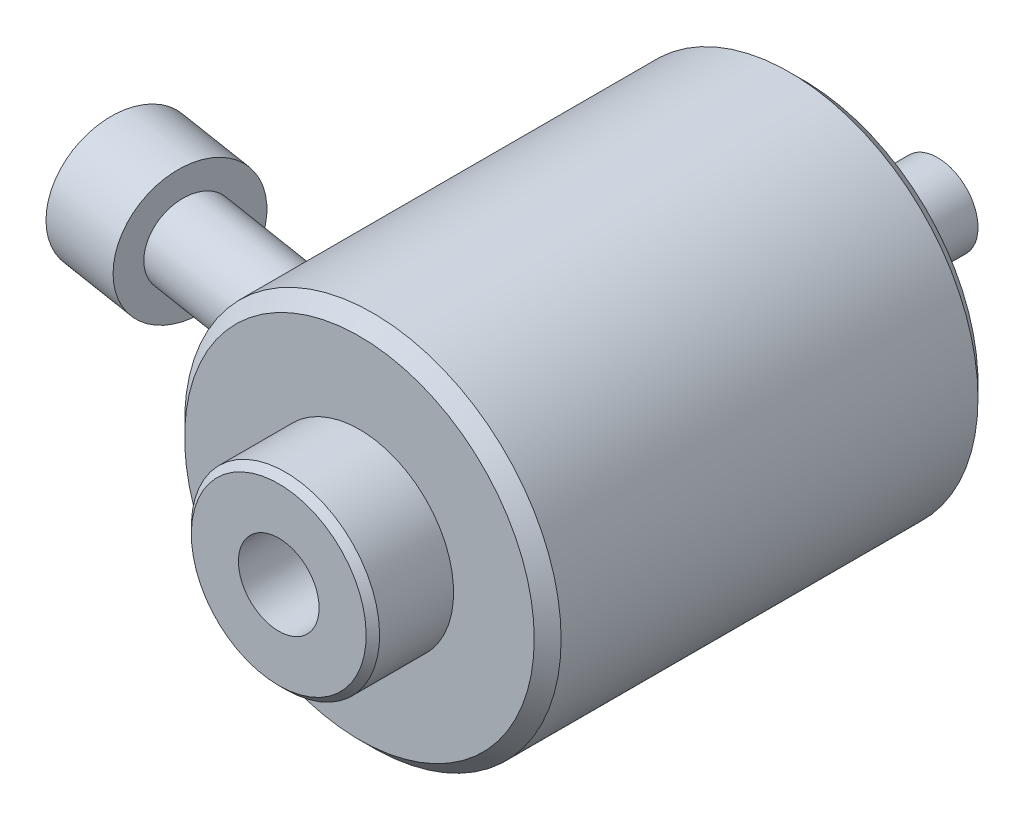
ISO-10303-21;
HEADER;
FILE_DESCRIPTION(('STEP AP214'),'2;1');
FILE_NAME('part.step','',(''),(''),'','','');
FILE_SCHEMA(('AUTOMOTIVE_DESIGN { 1 0 10303 214 1 1 1 1 }'));
ENDSEC;
DATA;
#1=APPLICATION_CONTEXT('core data for automotive mechanical design processes');
#2=APPLICATION_PROTOCOL_DEFINITION('international standard','automotive_design',2000,#1);
#3=PRODUCT_CONTEXT('',#1,'mechanical');
#4=PRODUCT('Part','Part','',(#3));
#5=PRODUCT_RELATED_PRODUCT_CATEGORY('part','',(#4));
#6=PRODUCT_DEFINITION_FORMATION('','',#4);
#7=PRODUCT_DEFINITION_CONTEXT('part definition',#1,'design');
#8=PRODUCT_DEFINITION('design','',#6,#7);
#9=PRODUCT_DEFINITION_SHAPE('','',#8);
#10=(LENGTH_UNIT() NAMED_UNIT(*) SI_UNIT(.MILLI.,.METRE.));
#11=(NAMED_UNIT(*) PLANE_ANGLE_UNIT() SI_UNIT($,.RADIAN.));
#12=(NAMED_UNIT(*) SI_UNIT($,.STERADIAN.) SOLID_ANGLE_UNIT());
#13=UNCERTAINTY_MEASURE_WITH_UNIT(LENGTH_MEASURE(1.E-05),#10,'distance_accuracy_value','');
#14=(GEOMETRIC_REPRESENTATION_CONTEXT(3) GLOBAL_UNCERTAINTY_ASSIGNED_CONTEXT((#13)) GLOBAL_UNIT_ASSIGNED_CONTEXT((#10,
#11,#12)) REPRESENTATION_CONTEXT('',''));
#15=CARTESIAN_POINT('',(0.,0.,0.));
#16=DIRECTION('',(0.,0.,1.));
#17=DIRECTION('',(1.,0.,0.));
#18=AXIS2_PLACEMENT_3D('',#15,#16,#17);
#19=CARTESIAN_POINT('',(-22.4207300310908,0.,6.66628738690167));
#20=DIRECTION('',(-0.987688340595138,0.,-0.156434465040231));
#21=DIRECTION('',(-0.156434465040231,0.,0.987688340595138));
#22=AXIS2_PLACEMENT_3D('',#19,#20,#21);
#23=CYLINDRICAL_SURFACE('',#22,1.25);
#24=CARTESIAN_POINT('',(-14.,0.,9.265581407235));
#25=CARTESIAN_POINT('',(-13.9999992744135,0.0700489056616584,9.26557846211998));
#26=CARTESIAN_POINT('',(-13.9994686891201,0.140145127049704,9.25968411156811));
#27=CARTESIAN_POINT('',(-13.9974028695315,0.278403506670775,9.23624875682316));
#28=CARTESIAN_POINT('',(-13.9958665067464,0.346563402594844,9.21869466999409));
#29=CARTESIAN_POINT('',(-13.991962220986,0.478932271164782,9.17242700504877));
#30=CARTESIAN_POINT('',(-13.9895946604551,0.54314295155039,9.14371829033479));
#31=CARTESIAN_POINT('',(-13.9842942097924,0.665799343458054,9.07594885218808));
#32=CARTESIAN_POINT('',(-13.9813614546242,0.724246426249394,9.03689059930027));
#33=CARTESIAN_POINT('',(-13.9752599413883,0.833739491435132,8.94951878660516));
#34=CARTESIAN_POINT('',(-13.9720911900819,0.884785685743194,8.90120549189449));
#35=CARTESIAN_POINT('',(-13.9658731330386,0.978048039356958,8.79669132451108));
#36=CARTESIAN_POINT('',(-13.962823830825,1.02026393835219,8.74049021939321));
#37=CARTESIAN_POINT('',(-13.9571815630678,1.09475351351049,8.62172436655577));
#38=CARTESIAN_POINT('',(-13.9545891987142,1.12701413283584,8.5591514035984));
#39=CARTESIAN_POINT('',(-13.9501524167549,1.18066768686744,8.42948568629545));
#40=CARTESIAN_POINT('',(-13.9483080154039,1.20206038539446,8.36239283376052));
#41=CARTESIAN_POINT('',(-13.9455579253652,1.2335592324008,8.22514336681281));
#42=CARTESIAN_POINT('',(-13.9446582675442,1.24359290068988,8.1549700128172));
#43=CARTESIAN_POINT('',(-13.9439113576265,1.25193996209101,8.01392542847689));
#44=CARTESIAN_POINT('',(-13.9440641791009,1.25025253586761,7.94305414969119));
#45=CARTESIAN_POINT('',(-13.945406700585,1.23518787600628,7.80167436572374));
#46=CARTESIAN_POINT('',(-13.946609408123,1.22166398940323,7.73118161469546));
#47=CARTESIAN_POINT('',(-13.9499289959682,1.18315306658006,7.59342024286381));
#48=CARTESIAN_POINT('',(-13.952045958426,1.15816500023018,7.52615191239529));
#49=CARTESIAN_POINT('',(-13.9569842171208,1.09705886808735,7.39593546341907));
#50=CARTESIAN_POINT('',(-13.9598134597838,1.06081407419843,7.33304705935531));
#51=CARTESIAN_POINT('',(-13.9658404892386,0.978266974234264,7.21427220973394));
#52=CARTESIAN_POINT('',(-13.9690382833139,0.931964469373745,7.15838590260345));
#53=CARTESIAN_POINT('',(-13.9754283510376,0.830642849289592,7.05539857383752));
#54=CARTESIAN_POINT('',(-13.9786206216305,0.775642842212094,7.00827877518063));
#55=CARTESIAN_POINT('',(-13.9846348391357,0.658352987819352,6.92417260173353));
#56=CARTESIAN_POINT('',(-13.9874568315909,0.596064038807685,6.88718498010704));
#57=CARTESIAN_POINT('',(-13.9923426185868,0.467338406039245,6.82525143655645));
#58=CARTESIAN_POINT('',(-13.9944210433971,0.401015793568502,6.80006972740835));
#59=CARTESIAN_POINT('',(-13.9976566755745,0.265005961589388,6.76149804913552));
#60=CARTESIAN_POINT('',(-13.9988140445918,0.195319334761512,6.7481060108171));
#61=CARTESIAN_POINT('',(-14.0000537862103,0.0564809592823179,6.73378130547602));
#62=CARTESIAN_POINT('',(-14.0001629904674,-0.012638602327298,6.7325376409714));
#63=CARTESIAN_POINT('',(-13.9993641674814,-0.150084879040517,6.74174192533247));
#64=CARTESIAN_POINT('',(-13.9984562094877,-0.218411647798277,6.75218907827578));
#65=CARTESIAN_POINT('',(-13.9957384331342,-0.351734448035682,6.78427012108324));
#66=CARTESIAN_POINT('',(-13.9939364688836,-0.416754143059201,6.80580664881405));
#67=CARTESIAN_POINT('',(-13.9896331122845,-0.542325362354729,6.85930191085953));
#68=CARTESIAN_POINT('',(-13.9871316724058,-0.602876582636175,6.89126135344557));
#69=CARTESIAN_POINT('',(-13.981655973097,-0.718833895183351,6.96518384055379));
#70=CARTESIAN_POINT('',(-13.9786749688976,-0.774145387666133,7.00729465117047));
#71=CARTESIAN_POINT('',(-13.9725910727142,-0.877134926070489,7.09998808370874));
#72=CARTESIAN_POINT('',(-13.9694881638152,-0.924811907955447,7.15057188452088));
#73=CARTESIAN_POINT('',(-13.9634106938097,-1.01249626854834,7.26021995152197));
#74=CARTESIAN_POINT('',(-13.9604416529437,-1.05226901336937,7.31947223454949));
#75=CARTESIAN_POINT('',(-13.9550500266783,-1.12151209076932,7.44374331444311));
#76=CARTESIAN_POINT('',(-13.9526274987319,-1.15098134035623,7.50876271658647));
#77=CARTESIAN_POINT('',(-13.9485640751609,-1.19923334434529,7.64391724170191));
#78=CARTESIAN_POINT('',(-13.9469369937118,-1.21782826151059,7.7141199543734));
#79=CARTESIAN_POINT('',(-13.9447171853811,-1.24299013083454,7.85666739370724));
#80=CARTESIAN_POINT('',(-13.9441244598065,-1.24955706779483,7.92901212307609));
#81=CARTESIAN_POINT('',(-13.9440490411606,-1.25039868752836,8.07363983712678));
#82=CARTESIAN_POINT('',(-13.9445642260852,-1.24469686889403,8.14592267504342));
#83=CARTESIAN_POINT('',(-13.9466486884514,-1.2211178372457,8.28846013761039));
#84=CARTESIAN_POINT('',(-13.9482178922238,-1.2032414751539,8.35871490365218));
#85=CARTESIAN_POINT('',(-13.9522068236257,-1.15605945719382,8.49422472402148));
#86=CARTESIAN_POINT('',(-13.9546152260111,-1.12690544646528,8.5595329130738));
#87=CARTESIAN_POINT('',(-13.9600126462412,-1.05794026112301,8.68422725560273));
#88=CARTESIAN_POINT('',(-13.9630016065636,-1.01813014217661,8.74361399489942));
#89=CARTESIAN_POINT('',(-13.969180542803,-0.929483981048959,8.85408358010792));
#90=CARTESIAN_POINT('',(-13.9723678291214,-0.880756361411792,8.9052536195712));
#91=CARTESIAN_POINT('',(-13.9786132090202,-0.775341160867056,8.99864440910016));
#92=CARTESIAN_POINT('',(-13.9816712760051,-0.718651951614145,9.04086332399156));
#93=CARTESIAN_POINT('',(-13.9872981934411,-0.599204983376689,9.11497471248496));
#94=CARTESIAN_POINT('',(-13.9898690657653,-0.536474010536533,9.14691026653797));
#95=CARTESIAN_POINT('',(-13.9942455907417,-0.406567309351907,9.19977912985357));
#96=CARTESIAN_POINT('',(-13.9960521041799,-0.339396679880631,9.22072482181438));
#97=CARTESIAN_POINT('',(-13.9982381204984,-0.226533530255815,9.24575973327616));
#98=CARTESIAN_POINT('',(-13.9988958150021,-0.181557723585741,9.25318335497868));
#99=CARTESIAN_POINT('',(-13.999776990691,-0.0910612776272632,9.26309515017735));
#100=CARTESIAN_POINT('',(-14.0000004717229,-0.0455406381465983,9.26558332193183));
#101=CARTESIAN_POINT('',(-14.,0.,9.265581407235));
#102=B_SPLINE_CURVE_WITH_KNOTS('',3,(#24,#25,#26,#27,#28,#29,#30,#31,#32,#33,#34,#35,#36,#37,
#38,#39,#40,#41,#42,#43,#44,#45,#46,#47,#48,#49,#50,#51,#52,#53,#54,#55,#56,#57,#58,#59,#60,#61,
#62,#63,#64,#65,#66,#67,#68,#69,#70,#71,#72,#73,#74,#75,#76,#77,#78,#79,#80,#81,#82,#83,#84,#85,
#86,#87,#88,#89,#90,#91,#92,#93,#94,#95,#96,#97,#98,#99,#100,#101),.UNSPECIFIED.,.T.,.F.,(4,2,2,
2,2,2,2,2,2,2,2,2,2,2,2,2,2,2,2,2,2,2,2,2,2,2,2,2,2,2,2,2,2,2,2,2,2,2,4),(0.,0.209980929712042,
0.42019786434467,0.630323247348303,0.840398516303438,1.05046776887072,1.26054321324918,
1.4708930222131,1.68124740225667,1.89293658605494,2.10464056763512,2.31900528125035,
2.53338926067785,2.75028006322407,2.96717515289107,3.18360018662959,3.39999857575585,
3.61186862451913,3.82370148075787,4.0300967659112,4.23647800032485,4.44107739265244,
4.64569069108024,4.85348431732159,5.06130687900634,5.27459406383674,5.48790366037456,
5.70479661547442,5.92168984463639,6.13816802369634,6.354631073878,6.56827931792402,
6.7819064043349,6.99309054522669,7.204317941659,7.41464856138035,7.62474168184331,
7.76125576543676,7.89776989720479),.UNSPECIFIED.);
#103=CARTESIAN_POINT('',(-14.,0.,9.265581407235));
#104=VERTEX_POINT('',#103);
#105=EDGE_CURVE('P0_E172',#104,#104,#102,.T.);
#106=ORIENTED_EDGE('',*,*,#105,.T.);
#107=EDGE_LOOP('',(#106));
#108=FACE_BOUND('',#107,.T.);
#109=CARTESIAN_POINT('',(-10.2212553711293,0.,9.86407576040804));
#110=CARTESIAN_POINT('',(-10.2212544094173,0.070151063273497,9.86407295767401));
#111=CARTESIAN_POINT('',(-10.2205256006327,0.14034638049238,9.85819293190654));
#112=CARTESIAN_POINT('',(-10.2176877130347,0.27879800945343,9.83481128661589));
#113=CARTESIAN_POINT('',(-10.2155771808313,0.347052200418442,9.81729742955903));
#114=CARTESIAN_POINT('',(-10.2102123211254,0.479608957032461,9.7711204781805));
#115=CARTESIAN_POINT('',(-10.2069584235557,0.543912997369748,9.74246157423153));
#116=CARTESIAN_POINT('',(-10.1996716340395,0.666745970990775,9.67478049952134));
#117=CARTESIAN_POINT('',(-10.1956389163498,0.725276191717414,9.63576064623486));
#118=CARTESIAN_POINT('',(-10.1872509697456,0.834866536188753,9.54846790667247));
#119=CARTESIAN_POINT('',(-10.1828960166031,0.885932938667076,9.50020287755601));
#120=CARTESIAN_POINT('',(-10.174350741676,0.979207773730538,9.39574832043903));
#121=CARTESIAN_POINT('',(-10.1701604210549,1.02141614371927,9.33955873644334));
#122=CARTESIAN_POINT('',(-10.1624222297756,1.09573481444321,9.22095193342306));
#123=CARTESIAN_POINT('',(-10.1588732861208,1.12786204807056,9.15854539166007));
#124=CARTESIAN_POINT('',(-10.152803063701,1.18126101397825,9.02920568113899));
#125=CARTESIAN_POINT('',(-10.1502817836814,1.20253275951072,8.96227251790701));
#126=CARTESIAN_POINT('',(-10.1465335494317,1.23376213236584,8.82555598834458));
#127=CARTESIAN_POINT('',(-10.145310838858,1.24368267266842,8.75576404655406));
#128=CARTESIAN_POINT('',(-10.1442975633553,1.25192072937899,8.61549077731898));
#129=CARTESIAN_POINT('',(-10.1445071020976,1.25023740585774,8.54500940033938));
#130=CARTESIAN_POINT('',(-10.1463343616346,1.23532050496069,8.4043232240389));
#131=CARTESIAN_POINT('',(-10.1479713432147,1.22192893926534,8.33413545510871));
#132=CARTESIAN_POINT('',(-10.152485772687,1.18383213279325,8.19694032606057));
#133=CARTESIAN_POINT('',(-10.1553633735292,1.15912549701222,8.12993335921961));
#134=CARTESIAN_POINT('',(-10.1620944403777,1.09856216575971,7.99977033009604));
#135=CARTESIAN_POINT('',(-10.1659641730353,1.06251708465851,7.93670267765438));
#136=CARTESIAN_POINT('',(-10.1742124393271,0.980387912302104,7.81751147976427));
#137=CARTESIAN_POINT('',(-10.1785910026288,0.934303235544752,7.76138833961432));
#138=CARTESIAN_POINT('',(-10.187367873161,0.833170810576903,7.65762608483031));
#139=CARTESIAN_POINT('',(-10.1917662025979,0.778102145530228,7.61000732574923));
#140=CARTESIAN_POINT('',(-10.2000584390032,0.660554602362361,7.52495337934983));
#141=CARTESIAN_POINT('',(-10.2039524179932,0.598076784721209,7.48751673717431));
#142=CARTESIAN_POINT('',(-10.2106867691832,0.469047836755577,7.42489820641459));
#143=CARTESIAN_POINT('',(-10.2135501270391,0.402629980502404,7.39944446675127));
#144=CARTESIAN_POINT('',(-10.2180114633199,0.26635165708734,7.36042170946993));
#145=CARTESIAN_POINT('',(-10.2196097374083,0.196491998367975,7.34684991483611));
#146=CARTESIAN_POINT('',(-10.2213193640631,0.0578075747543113,7.33235429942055));
#147=CARTESIAN_POINT('',(-10.2214783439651,-0.0109744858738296,7.33102532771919));
#148=CARTESIAN_POINT('',(-10.2204161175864,-0.14775884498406,7.34000539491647));
#149=CARTESIAN_POINT('',(-10.219195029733,-0.215761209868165,7.35031343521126));
#150=CARTESIAN_POINT('',(-10.215533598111,-0.348252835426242,7.38200152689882));
#151=CARTESIAN_POINT('',(-10.2131075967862,-0.412773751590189,7.4032514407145));
#152=CARTESIAN_POINT('',(-10.2073082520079,-0.537416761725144,7.45602460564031));
#153=CARTESIAN_POINT('',(-10.2039348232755,-0.597538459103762,7.48754878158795));
#154=CARTESIAN_POINT('',(-10.1965225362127,-0.713028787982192,7.56061592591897));
#155=CARTESIAN_POINT('',(-10.192471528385,-0.768275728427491,7.60234980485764));
#156=CARTESIAN_POINT('',(-10.1841867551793,-0.87124939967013,7.69422843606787));
#157=CARTESIAN_POINT('',(-10.1799529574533,-0.918974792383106,7.74437468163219));
#158=CARTESIAN_POINT('',(-10.171607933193,-1.00721761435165,7.85348255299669));
#159=CARTESIAN_POINT('',(-10.1675055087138,-1.04744143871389,7.9126824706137));
#160=CARTESIAN_POINT('',(-10.1600313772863,-1.11761966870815,8.03693068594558));
#161=CARTESIAN_POINT('',(-10.156659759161,-1.14757282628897,8.10197969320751));
#162=CARTESIAN_POINT('',(-10.1509722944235,-1.19685166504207,8.23740533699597));
#163=CARTESIAN_POINT('',(-10.1486771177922,-1.21597064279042,8.30785823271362));
#164=CARTESIAN_POINT('',(-10.145512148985,-1.24210328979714,8.45100864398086));
#165=CARTESIAN_POINT('',(-10.1446423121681,-1.2491173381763,8.5237060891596));
#166=CARTESIAN_POINT('',(-10.1444448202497,-1.25072041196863,8.66874098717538));
#167=CARTESIAN_POINT('',(-10.1451065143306,-1.24539524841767,8.74107744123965));
#168=CARTESIAN_POINT('',(-10.1478874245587,-1.22252745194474,8.88376455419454));
#169=CARTESIAN_POINT('',(-10.1500064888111,-1.2049860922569,8.95411541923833));
#170=CARTESIAN_POINT('',(-10.1554124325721,-1.15852998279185,9.08947747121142));
#171=CARTESIAN_POINT('',(-10.1586774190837,-1.1298274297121,9.15456239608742));
#172=CARTESIAN_POINT('',(-10.1660110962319,-1.06181173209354,9.27887633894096));
#173=CARTESIAN_POINT('',(-10.1700797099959,-1.02249960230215,9.33810591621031));
#174=CARTESIAN_POINT('',(-10.1785057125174,-0.934875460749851,9.44835672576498));
#175=CARTESIAN_POINT('',(-10.1828593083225,-0.886670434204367,9.49946333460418));
#176=CARTESIAN_POINT('',(-10.1914066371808,-0.782321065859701,9.59284369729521));
#177=CARTESIAN_POINT('',(-10.1956003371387,-0.726175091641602,9.6351156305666));
#178=CARTESIAN_POINT('',(-10.2033522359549,-0.60760876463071,9.70960806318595));
#179=CARTESIAN_POINT('',(-10.2069109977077,-0.545194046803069,9.74183748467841));
#180=CARTESIAN_POINT('',(-10.2129966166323,-0.415856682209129,9.79539488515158));
#181=CARTESIAN_POINT('',(-10.215524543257,-0.348938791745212,9.8167341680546));
#182=CARTESIAN_POINT('',(-10.2186636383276,-0.234740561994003,9.84289038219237));
#183=CARTESIAN_POINT('',(-10.2196308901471,-0.18815931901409,9.85082456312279));
#184=CARTESIAN_POINT('',(-10.2209270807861,-0.0943920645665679,9.861418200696));
#185=CARTESIAN_POINT('',(-10.2212560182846,-0.0472060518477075,9.86407764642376));
#186=CARTESIAN_POINT('',(-10.2212553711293,0.,9.86407576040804));
#187=B_SPLINE_CURVE_WITH_KNOTS('',3,(#109,#110,#111,#112,#113,#114,#115,#116,#117,#118,#119,
#120,#121,#122,#123,#124,#125,#126,#127,#128,#129,#130,#131,#132,#133,#134,#135,#136,#137,#138,
#139,#140,#141,#142,#143,#144,#145,#146,#147,#148,#149,#150,#151,#152,#153,#154,#155,#156,#157,
#158,#159,#160,#161,#162,#163,#164,#165,#166,#167,#168,#169,#170,#171,#172,#173,#174,#175,#176,
#177,#178,#179,#180,#181,#182,#183,#184,#185,#186),.UNSPECIFIED.,.T.,.F.,(4,2,2,2,2,2,2,2,2,2,2,
2,2,2,2,2,2,2,2,2,2,2,2,2,2,2,2,2,2,2,2,2,2,2,2,2,2,2,4),(0.,0.210281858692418,
0.420785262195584,0.631209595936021,0.841586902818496,1.05178620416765,1.26198699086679,
1.47183279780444,1.6816783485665,1.89220757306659,2.10275203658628,2.31618216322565,
2.52963861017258,2.74684769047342,2.96406944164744,3.18180434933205,3.39950812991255,
3.61200157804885,3.82444534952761,4.02983241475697,4.23520185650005,4.4381832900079,
4.64118299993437,4.84831568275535,5.05548517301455,5.26956651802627,5.48367386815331,
5.70173935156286,5.91979800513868,6.13634476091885,6.352868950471,6.56546338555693,
6.77803749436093,6.98820378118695,7.19841333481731,7.40843559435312,7.61823940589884,
7.7597419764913,7.90124483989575),.UNSPECIFIED.);
#188=CARTESIAN_POINT('',(-10.2212553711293,0.,9.86407576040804));
#189=VERTEX_POINT('',#188);
#190=EDGE_CURVE('P0_E11',#189,#189,#187,.T.);
#191=ORIENTED_EDGE('',*,*,#190,.F.);
#192=EDGE_LOOP('',(#191));
#193=FACE_BOUND('',#192,.T.);
#194=ADVANCED_FACE('P0_F16',(#108,#193),#23,.F.);
#195=CARTESIAN_POINT('',(0.,-4.,21.));
#196=DIRECTION('',(0.,-1.,0.));
#197=DIRECTION('',(0.,0.,-1.));
#198=AXIS2_PLACEMENT_3D('',#195,#196,#197);
#199=CYLINDRICAL_SURFACE('',#198,2.);
#200=CARTESIAN_POINT('',(0.,-12.,21.));
#201=DIRECTION('',(0.,-1.,0.));
#202=DIRECTION('',(0.,0.,-1.));
#203=AXIS2_PLACEMENT_3D('',#200,#201,#202);
#204=CIRCLE('',#203,2.);
#205=CARTESIAN_POINT('',(0.,-12.,19.));
#206=VERTEX_POINT('',#205);
#207=EDGE_CURVE('P0_E30',#206,#206,#204,.T.);
#208=ORIENTED_EDGE('',*,*,#207,.F.);
#209=EDGE_LOOP('',(#208));
#210=FACE_BOUND('',#209,.T.);
#211=CARTESIAN_POINT('',(0.,-14.,19.));
#212=CARTESIAN_POINT('',(-0.111730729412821,-13.9999982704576,19.0000046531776));
#213=CARTESIAN_POINT('',(-0.223527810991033,-13.9986484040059,19.0093944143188));
#214=CARTESIAN_POINT('',(-0.444001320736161,-13.9933934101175,19.046698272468));
#215=CARTESIAN_POINT('',(-0.552674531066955,-13.9894857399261,19.0746308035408));
#216=CARTESIAN_POINT('',(-0.763677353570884,-13.9795546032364,19.1481721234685));
#217=CARTESIAN_POINT('',(-0.866011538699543,-13.9735326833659,19.193767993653));
#218=CARTESIAN_POINT('',(-1.06155930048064,-13.9600397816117,19.3013110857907));
#219=CARTESIAN_POINT('',(-1.1547742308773,-13.9525690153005,19.3632558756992));
#220=CARTESIAN_POINT('',(-1.33011730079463,-13.9369507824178,19.5022083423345));
#221=CARTESIAN_POINT('',(-1.41217118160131,-13.9287993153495,19.5793092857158));
#222=CARTESIAN_POINT('',(-1.56222258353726,-13.9127699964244,19.7461848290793));
#223=CARTESIAN_POINT('',(-1.63021932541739,-13.9048921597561,19.8359601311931));
#224=CARTESIAN_POINT('',(-1.75051175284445,-13.8902631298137,20.0261302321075));
#225=CARTESIAN_POINT('',(-1.80273625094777,-13.8835171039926,20.1265704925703));
#226=CARTESIAN_POINT('',(-1.8895469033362,-13.8719696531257,20.3349090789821));
#227=CARTESIAN_POINT('',(-1.92413392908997,-13.8671681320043,20.4428070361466));
#228=CARTESIAN_POINT('',(-1.97445864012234,-13.8600923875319,20.662220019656));
#229=CARTESIAN_POINT('',(-1.99032297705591,-13.8578011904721,20.7737054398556));
#230=CARTESIAN_POINT('',(-2.00314420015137,-13.8559538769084,20.9977778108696));
#231=CARTESIAN_POINT('',(-2.00010207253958,-13.8563976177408,21.1103647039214));
#232=CARTESIAN_POINT('',(-1.97530036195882,-13.8599545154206,21.3325530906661));
#233=CARTESIAN_POINT('',(-1.953681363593,-13.8630476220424,21.4421706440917));
#234=CARTESIAN_POINT('',(-1.89255944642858,-13.8715234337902,21.6562061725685));
#235=CARTESIAN_POINT('',(-1.85305606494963,-13.8769061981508,21.7606240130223));
#236=CARTESIAN_POINT('',(-1.75713904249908,-13.8893771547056,21.9617265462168));
#237=CARTESIAN_POINT('',(-1.70066538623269,-13.8964713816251,22.0583822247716));
#238=CARTESIAN_POINT('',(-1.57245369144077,-13.9115614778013,22.2408984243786));
#239=CARTESIAN_POINT('',(-1.50071474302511,-13.9195574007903,22.3267583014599));
#240=CARTESIAN_POINT('',(-1.34323491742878,-13.935638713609,22.4860608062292));
#241=CARTESIAN_POINT('',(-1.25737307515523,-13.9437242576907,22.5593838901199));
#242=CARTESIAN_POINT('',(-1.07449831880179,-13.9590063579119,22.6905970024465));
#243=CARTESIAN_POINT('',(-0.977485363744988,-13.9662029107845,22.7484869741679));
#244=CARTESIAN_POINT('',(-0.774962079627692,-13.9789027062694,22.8471948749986));
#245=CARTESIAN_POINT('',(-0.669447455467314,-13.9844050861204,22.8880041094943));
#246=CARTESIAN_POINT('',(-0.4529666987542,-13.9930891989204,22.9512909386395));
#247=CARTESIAN_POINT('',(-0.342000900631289,-13.9962710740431,22.9737696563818));
#248=CARTESIAN_POINT('',(-0.118800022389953,-13.9999369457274,22.9995996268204));
#249=CARTESIAN_POINT('',(-0.00658433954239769,-14.0004441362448,23.0031153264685));
#250=CARTESIAN_POINT('',(0.216834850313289,-13.998766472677,22.9913551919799));
#251=CARTESIAN_POINT('',(0.32803838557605,-13.9965816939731,22.9760798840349));
#252=CARTESIAN_POINT('',(0.545782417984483,-13.989779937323,22.9273080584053));
#253=CARTESIAN_POINT('',(0.652341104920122,-13.9851735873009,22.8938911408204));
#254=CARTESIAN_POINT('',(0.858342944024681,-13.9740437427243,22.8098682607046));
#255=CARTESIAN_POINT('',(0.957785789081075,-13.9675201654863,22.7592615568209));
#256=CARTESIAN_POINT('',(1.14745969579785,-13.9532237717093,22.6419061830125));
#257=CARTESIAN_POINT('',(1.23762521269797,-13.9454429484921,22.5750525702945));
#258=CARTESIAN_POINT('',(1.40551529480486,-13.9295244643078,22.4272479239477));
#259=CARTESIAN_POINT('',(1.48323920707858,-13.9213867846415,22.3462961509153));
#260=CARTESIAN_POINT('',(1.62463364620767,-13.905598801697,22.1718632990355));
#261=CARTESIAN_POINT('',(1.68819430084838,-13.8979526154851,22.0782927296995));
#262=CARTESIAN_POINT('',(1.79869568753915,-13.8840847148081,21.881706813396));
#263=CARTESIAN_POINT('',(1.84563683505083,-13.8778629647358,21.7786917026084));
#264=CARTESIAN_POINT('',(1.92139410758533,-13.8675777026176,21.5664766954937));
#265=CARTESIAN_POINT('',(1.9502693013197,-13.8635071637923,21.4572982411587));
#266=CARTESIAN_POINT('',(1.98926373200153,-13.8579660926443,21.2355794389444));
#267=CARTESIAN_POINT('',(1.99938413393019,-13.8564953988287,21.1230393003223));
#268=CARTESIAN_POINT('',(2.0005559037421,-13.8563261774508,20.8988861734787));
#269=CARTESIAN_POINT('',(1.99177997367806,-13.8576025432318,20.7872740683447));
#270=CARTESIAN_POINT('',(1.955776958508,-13.8627292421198,20.5671298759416));
#271=CARTESIAN_POINT('',(1.9285498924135,-13.8665795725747,20.458597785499));
#272=CARTESIAN_POINT('',(1.85647645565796,-13.8764118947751,20.2477347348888));
#273=CARTESIAN_POINT('',(1.81164102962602,-13.8823925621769,20.145399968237));
#274=CARTESIAN_POINT('',(1.70564064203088,-13.8958134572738,19.9496775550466));
#275=CARTESIAN_POINT('',(1.6444752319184,-13.9032537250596,19.8562901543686));
#276=CARTESIAN_POINT('',(1.50691947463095,-13.9188366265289,19.6802341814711));
#277=CARTESIAN_POINT('',(1.43040092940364,-13.9269848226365,19.5976662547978));
#278=CARTESIAN_POINT('',(1.26458151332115,-13.9430182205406,19.4464802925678));
#279=CARTESIAN_POINT('',(1.17527766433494,-13.9509033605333,19.3778655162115));
#280=CARTESIAN_POINT('',(0.985903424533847,-13.9655666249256,19.2562324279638));
#281=CARTESIAN_POINT('',(0.885781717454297,-13.9723390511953,19.2032933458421));
#282=CARTESIAN_POINT('',(0.678021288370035,-13.9839575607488,19.1150602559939));
#283=CARTESIAN_POINT('',(0.570390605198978,-13.9888056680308,19.0797476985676));
#284=CARTESIAN_POINT('',(0.385211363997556,-13.9949036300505,19.0359164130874));
#285=CARTESIAN_POINT('',(0.308813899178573,-13.9968051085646,19.0224679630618));
#286=CARTESIAN_POINT('',(0.154954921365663,-13.9993538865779,19.0045081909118));
#287=CARTESIAN_POINT('',(0.0774934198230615,-14.0000011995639,18.9999967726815));
#288=CARTESIAN_POINT('',(0.,-14.,19.));
#289=B_SPLINE_CURVE_WITH_KNOTS('',3,(#211,#212,#213,#214,#215,#216,#217,#218,#219,#220,#221,
#222,#223,#224,#225,#226,#227,#228,#229,#230,#231,#232,#233,#234,#235,#236,#237,#238,#239,#240,
#241,#242,#243,#244,#245,#246,#247,#248,#249,#250,#251,#252,#253,#254,#255,#256,#257,#258,#259,
#260,#261,#262,#263,#264,#265,#266,#267,#268,#269,#270,#271,#272,#273,#274,#275,#276,#277,#278,
#279,#280,#281,#282,#283,#284,#285,#286,#287,#288),.UNSPECIFIED.,.T.,.F.,(4,2,2,2,2,2,2,2,2,2,2,
2,2,2,2,2,2,2,2,2,2,2,2,2,2,2,2,2,2,2,2,2,2,2,2,2,2,2,4),(0.,0.334909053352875,
0.670151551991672,1.00514932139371,1.34009728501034,1.67717486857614,2.01427113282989,
2.35286688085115,2.69144589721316,3.02772118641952,3.36397893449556,3.69771416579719,
4.03145803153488,4.36639635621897,4.70135465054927,5.03934756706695,5.3773417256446,
5.71550772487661,6.05365300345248,6.38886112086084,6.7240598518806,7.0577995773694,
7.3915536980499,7.72752375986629,8.06351144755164,8.40202124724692,8.74052258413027,
9.07791128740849,9.4152790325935,9.74957651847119,10.0838736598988,10.4179633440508,
10.752062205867,11.0890764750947,11.4261693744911,11.7649380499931,12.1033494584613,
12.3356358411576,12.5679197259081),.UNSPECIFIED.);
#290=CARTESIAN_POINT('',(0.,-14.,19.));
#291=VERTEX_POINT('',#290);
#292=EDGE_CURVE('P0_E163',#291,#291,#289,.T.);
#293=ORIENTED_EDGE('',*,*,#292,.F.);
#294=EDGE_LOOP('',(#293));
#295=FACE_BOUND('',#294,.T.);
#296=ADVANCED_FACE('P0_F180',(#210,#295),#199,.F.);
#297=CARTESIAN_POINT('',(0.,0.,0.));
#298=DIRECTION('',(0.,0.,1.));
#299=DIRECTION('',(1.,0.,0.));
#300=AXIS2_PLACEMENT_3D('',#297,#298,#299);
#301=CYLINDRICAL_SURFACE('',#300,14.);
#302=CARTESIAN_POINT('',(0.,0.,1.));
#303=DIRECTION('',(0.,0.,-1.));
#304=DIRECTION('',(-1.,0.,0.));
#305=AXIS2_PLACEMENT_3D('',#302,#303,#304);
#306=CIRCLE('',#305,14.);
#307=CARTESIAN_POINT('',(-14.,0.,1.));
#308=VERTEX_POINT('',#307);
#309=EDGE_CURVE('P0_E211',#308,#308,#306,.F.);
#310=ORIENTED_EDGE('',*,*,#309,.T.);
#311=EDGE_LOOP('',(#310));
#312=FACE_BOUND('',#311,.T.);
#313=CARTESIAN_POINT('',(0.,0.,32.));
#314=DIRECTION('',(0.,0.,1.));
#315=DIRECTION('',(1.,0.,0.));
#316=AXIS2_PLACEMENT_3D('',#313,#314,#315);
#317=CIRCLE('',#316,14.);
#318=CARTESIAN_POINT('',(14.,0.,32.));
#319=VERTEX_POINT('',#318);
#320=EDGE_CURVE('P0_E207',#319,#319,#317,.F.);
#321=ORIENTED_EDGE('',*,*,#320,.T.);
#322=EDGE_LOOP('',(#321));
#323=FACE_BOUND('',#322,.T.);
#324=ORIENTED_EDGE('',*,*,#105,.F.);
#325=EDGE_LOOP('',(#324));
#326=FACE_BOUND('',#325,.T.);
#327=CARTESIAN_POINT('',(-14.,0.,25.0341274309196));
#328=CARTESIAN_POINT('',(-13.9999967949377,0.168510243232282,25.0341221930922));
#329=CARTESIAN_POINT('',(-13.9969271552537,0.337094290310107,25.0201957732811));
#330=CARTESIAN_POINT('',(-13.9849715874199,0.669555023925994,24.9648179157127));
#331=CARTESIAN_POINT('',(-13.9760813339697,0.833428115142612,24.9233460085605));
#332=CARTESIAN_POINT('',(-13.9534610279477,1.15168232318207,24.8139527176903));
#333=CARTESIAN_POINT('',(-13.9397327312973,1.30606685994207,24.7460409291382));
#334=CARTESIAN_POINT('',(-13.9089449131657,1.60101990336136,24.585515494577));
#335=CARTESIAN_POINT('',(-13.8918858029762,1.74159011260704,24.4929048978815));
#336=CARTESIAN_POINT('',(-13.8563175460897,2.00503649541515,24.2853044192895));
#337=CARTESIAN_POINT('',(-13.8378075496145,2.12790217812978,24.1703013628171));
#338=CARTESIAN_POINT('',(-13.8014344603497,2.35230999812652,23.9210010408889));
#339=CARTESIAN_POINT('',(-13.7835713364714,2.45385316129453,23.7867047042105));
#340=CARTESIAN_POINT('',(-13.7506600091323,2.63201983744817,23.5035894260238));
#341=CARTESIAN_POINT('',(-13.7355918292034,2.70882333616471,23.3548861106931));
#342=CARTESIAN_POINT('',(-13.7098167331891,2.83640424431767,23.0463653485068));
#343=CARTESIAN_POINT('',(-13.6991093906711,2.88718419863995,22.8865489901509));
#344=CARTESIAN_POINT('',(-13.6833145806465,2.96113670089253,22.5620164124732));
#345=CARTESIAN_POINT('',(-13.678174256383,2.98456907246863,22.3973618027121));
#346=CARTESIAN_POINT('',(-13.6738246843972,3.00443368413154,22.0663677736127));
#347=CARTESIAN_POINT('',(-13.6746157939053,3.00086429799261,21.9000282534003));
#348=CARTESIAN_POINT('',(-13.6819874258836,2.9670717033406,21.568147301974));
#349=CARTESIAN_POINT('',(-13.6886395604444,2.93651878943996,21.4026412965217));
#350=CARTESIAN_POINT('',(-13.7070057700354,2.84955215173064,21.0788636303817));
#351=CARTESIAN_POINT('',(-13.7187209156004,2.79313295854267,20.9205935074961));
#352=CARTESIAN_POINT('',(-13.74639677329,2.65363814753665,20.6097298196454));
#353=CARTESIAN_POINT('',(-13.7624953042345,2.56967494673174,20.4575465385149));
#354=CARTESIAN_POINT('',(-13.7969051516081,2.37799586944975,20.169198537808));
#355=CARTESIAN_POINT('',(-13.8152169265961,2.27027506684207,20.0330371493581));
#356=CARTESIAN_POINT('',(-13.8524138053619,2.03114502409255,19.7778901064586));
#357=CARTESIAN_POINT('',(-13.8713028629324,1.89928479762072,19.6593264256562));
#358=CARTESIAN_POINT('',(-13.9070591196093,1.61676491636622,19.4468080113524));
#359=CARTESIAN_POINT('',(-13.9239266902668,1.46610872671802,19.3528487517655));
#360=CARTESIAN_POINT('',(-13.9531259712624,1.15495215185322,19.1955832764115));
#361=CARTESIAN_POINT('',(-13.9655807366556,0.994894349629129,19.1314266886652));
#362=CARTESIAN_POINT('',(-13.9851350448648,0.665674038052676,19.0323419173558));
#363=CARTESIAN_POINT('',(-13.9922370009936,0.496515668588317,18.9974005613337));
#364=CARTESIAN_POINT('',(-13.9999601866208,0.164539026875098,18.9594828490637));
#365=CARTESIAN_POINT('',(-14.0009354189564,0.00192682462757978,18.9547601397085));
#366=CARTESIAN_POINT('',(-13.9972387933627,-0.321677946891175,18.9728347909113));
#367=CARTESIAN_POINT('',(-13.9925677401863,-0.48267074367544,18.9956282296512));
#368=CARTESIAN_POINT('',(-13.9782819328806,-0.794662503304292,19.0669168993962));
#369=CARTESIAN_POINT('',(-13.9687839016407,-0.945806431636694,19.1148060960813));
#370=CARTESIAN_POINT('',(-13.9459117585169,-1.23817301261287,19.2341070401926));
#371=CARTESIAN_POINT('',(-13.932537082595,-1.37939421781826,19.3055222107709));
#372=CARTESIAN_POINT('',(-13.9027361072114,-1.65335871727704,19.4723915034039));
#373=CARTESIAN_POINT('',(-13.886219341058,-1.78563190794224,19.5685998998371));
#374=CARTESIAN_POINT('',(-13.8521499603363,-2.03312031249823,19.7807508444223));
#375=CARTESIAN_POINT('',(-13.834597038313,-2.14833042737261,19.8966992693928));
#376=CARTESIAN_POINT('',(-13.7992103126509,-2.36528573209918,20.1523431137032));
#377=CARTESIAN_POINT('',(-13.7814176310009,-2.46588751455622,20.2930160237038));
#378=CARTESIAN_POINT('',(-13.7485751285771,-2.64287932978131,20.5891621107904));
#379=CARTESIAN_POINT('',(-13.7335258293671,-2.7192647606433,20.7446380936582));
#380=CARTESIAN_POINT('',(-13.7075647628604,-2.84729172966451,21.0703611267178));
#381=CARTESIAN_POINT('',(-13.6967658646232,-2.89826678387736,21.2408803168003));
#382=CARTESIAN_POINT('',(-13.6812453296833,-2.97067716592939,21.5883550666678));
#383=CARTESIAN_POINT('',(-13.6765226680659,-2.99211747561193,21.765309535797));
#384=CARTESIAN_POINT('',(-13.6738903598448,-3.00412361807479,22.1159975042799));
#385=CARTESIAN_POINT('',(-13.6758169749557,-2.99543143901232,22.2897039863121));
#386=CARTESIAN_POINT('',(-13.6859977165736,-2.94856526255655,22.6328985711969));
#387=CARTESIAN_POINT('',(-13.6942504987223,-2.91039752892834,22.8023875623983));
#388=CARTESIAN_POINT('',(-13.7157581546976,-2.80724460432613,23.1261522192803));
#389=CARTESIAN_POINT('',(-13.7288298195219,-2.74323434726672,23.2807515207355));
#390=CARTESIAN_POINT('',(-13.7585167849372,-2.59022388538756,23.5766639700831));
#391=CARTESIAN_POINT('',(-13.7751318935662,-2.50122503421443,23.717977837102));
#392=CARTESIAN_POINT('',(-13.8098952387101,-2.30151160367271,23.9823889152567));
#393=CARTESIAN_POINT('',(-13.8280309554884,-2.19096601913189,24.1056155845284));
#394=CARTESIAN_POINT('',(-13.8639494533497,-1.95079942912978,24.331919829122));
#395=CARTESIAN_POINT('',(-13.8817321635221,-1.82117463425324,24.434993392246));
#396=CARTESIAN_POINT('',(-13.915198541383,-1.54492775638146,24.6193716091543));
#397=CARTESIAN_POINT('',(-13.9308567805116,-1.3981333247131,24.7004225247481));
#398=CARTESIAN_POINT('',(-13.958115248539,-1.09289844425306,24.8371247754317));
#399=CARTESIAN_POINT('',(-13.9697183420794,-0.934466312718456,24.892794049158));
#400=CARTESIAN_POINT('',(-13.9856285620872,-0.646628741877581,24.9679413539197));
#401=CARTESIAN_POINT('',(-13.9909861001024,-0.518637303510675,24.9927239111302));
#402=CARTESIAN_POINT('',(-13.9981730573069,-0.260445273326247,25.025818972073));
#403=CARTESIAN_POINT('',(-14.0000024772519,-0.130244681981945,25.0341314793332));
#404=CARTESIAN_POINT('',(-14.,0.,25.0341274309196));
#405=B_SPLINE_CURVE_WITH_KNOTS('',3,(#327,#328,#329,#330,#331,#332,#333,#334,#335,#336,#337,
#338,#339,#340,#341,#342,#343,#344,#345,#346,#347,#348,#349,#350,#351,#352,#353,#354,#355,#356,
#357,#358,#359,#360,#361,#362,#363,#364,#365,#366,#367,#368,#369,#370,#371,#372,#373,#374,#375,
#376,#377,#378,#379,#380,#381,#382,#383,#384,#385,#386,#387,#388,#389,#390,#391,#392,#393,#394,
#395,#396,#397,#398,#399,#400,#401,#402,#403,#404),.UNSPECIFIED.,.T.,.F.,(4,2,2,2,2,2,2,2,2,2,2,
2,2,2,2,2,2,2,2,2,2,2,2,2,2,2,2,2,2,2,2,2,2,2,2,2,2,2,4),(0.,0.505061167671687,1.01049807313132,
1.5157517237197,2.02094302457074,2.5264324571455,3.03189756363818,3.53359759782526,
4.03524856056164,4.53209361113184,5.02896858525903,5.53200007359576,6.03513797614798,
6.55641269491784,7.07779560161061,7.61015568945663,8.14241777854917,8.65838477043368,
9.17411899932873,9.6597571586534,10.1453261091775,10.6196755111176,11.0940939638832,
11.5851268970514,12.0763062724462,12.5955122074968,13.114816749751,13.6471065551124,
14.1793065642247,14.6984956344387,15.2175744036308,15.7186691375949,16.2197367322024,
16.7170219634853,17.2144060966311,17.7172988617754,18.21983565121,18.6102068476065,
19.000577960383),.UNSPECIFIED.);
#406=CARTESIAN_POINT('',(-14.,0.,25.0341274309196));
#407=VERTEX_POINT('',#406);
#408=EDGE_CURVE('P0_E196',#407,#407,#405,.T.);
#409=ORIENTED_EDGE('',*,*,#408,.F.);
#410=EDGE_LOOP('',(#409));
#411=FACE_BOUND('',#410,.T.);
#412=ORIENTED_EDGE('',*,*,#292,.T.);
#413=EDGE_LOOP('',(#412));
#414=FACE_BOUND('',#413,.T.);
#415=ADVANCED_FACE('P0_F177',(#312,#323,#326,#411,#414),#301,.T.);
#416=CARTESIAN_POINT('',(14.,0.,0.));
#417=DIRECTION('',(0.,0.,-1.));
#418=DIRECTION('',(-1.,0.,0.));
#419=AXIS2_PLACEMENT_3D('',#416,#417,#418);
#420=PLANE('',#419);
#421=CARTESIAN_POINT('',(0.,0.,0.));
#422=DIRECTION('',(0.,0.,-1.));
#423=DIRECTION('',(-1.,0.,0.));
#424=AXIS2_PLACEMENT_3D('',#421,#422,#423);
#425=CIRCLE('',#424,13.);
#426=CARTESIAN_POINT('',(-13.,0.,0.));
#427=VERTEX_POINT('',#426);
#428=EDGE_CURVE('P0_E215',#427,#427,#425,.T.);
#429=ORIENTED_EDGE('',*,*,#428,.T.);
#430=EDGE_LOOP('',(#429));
#431=FACE_BOUND('',#430,.T.);
#432=CARTESIAN_POINT('',(0.,0.,0.));
#433=DIRECTION('',(0.,0.,1.));
#434=DIRECTION('',(1.,0.,0.));
#435=AXIS2_PLACEMENT_3D('',#432,#433,#434);
#436=CIRCLE('',#435,3.3);
#437=CARTESIAN_POINT('',(3.3,0.,0.));
#438=VERTEX_POINT('',#437);
#439=EDGE_CURVE('P0_E203',#438,#438,#436,.T.);
#440=ORIENTED_EDGE('',*,*,#439,.T.);
#441=EDGE_LOOP('',(#440));
#442=FACE_BOUND('',#441,.T.);
#443=ADVANCED_FACE('P0_F232',(#431,#442),#420,.T.);
#444=CARTESIAN_POINT('',(0.,0.,33.));
#445=DIRECTION('',(0.,0.,1.));
#446=DIRECTION('',(1.,0.,0.));
#447=AXIS2_PLACEMENT_3D('',#444,#445,#446);
#448=PLANE('',#447);
#449=CARTESIAN_POINT('',(0.,0.,33.));
#450=DIRECTION('',(0.,0.,-1.));
#451=DIRECTION('',(-1.,0.,0.));
#452=AXIS2_PLACEMENT_3D('',#449,#450,#451);
#453=CIRCLE('',#452,7.);
#454=CARTESIAN_POINT('',(-7.,0.,33.));
#455=VERTEX_POINT('',#454);
#456=EDGE_CURVE('P0_E345',#455,#455,#453,.T.);
#457=ORIENTED_EDGE('',*,*,#456,.T.);
#458=EDGE_LOOP('',(#457));
#459=FACE_BOUND('',#458,.T.);
#460=CARTESIAN_POINT('',(0.,0.,33.));
#461=DIRECTION('',(0.,0.,1.));
#462=DIRECTION('',(1.,0.,0.));
#463=AXIS2_PLACEMENT_3D('',#460,#461,#462);
#464=CIRCLE('',#463,13.);
#465=CARTESIAN_POINT('',(13.,0.,33.));
#466=VERTEX_POINT('',#465);
#467=EDGE_CURVE('P0_E219',#466,#466,#464,.T.);
#468=ORIENTED_EDGE('',*,*,#467,.T.);
#469=EDGE_LOOP('',(#468));
#470=FACE_BOUND('',#469,.T.);
#471=ADVANCED_FACE('P0_F238',(#459,#470),#448,.T.);
#472=CARTESIAN_POINT('',(0.,0.,0.));
#473=DIRECTION('',(0.,0.,1.));
#474=DIRECTION('',(1.,0.,0.));
#475=AXIS2_PLACEMENT_3D('',#472,#473,#474);
#476=CYLINDRICAL_SURFACE('',#475,3.3);
#477=ORIENTED_EDGE('',*,*,#439,.F.);
#478=EDGE_LOOP('',(#477));
#479=FACE_BOUND('',#478,.T.);
#480=CARTESIAN_POINT('',(0.,0.,6.));
#481=DIRECTION('',(0.,0.,-1.));
#482=DIRECTION('',(-1.,0.,0.));
#483=AXIS2_PLACEMENT_3D('',#480,#481,#482);
#484=CIRCLE('',#483,3.3);
#485=CARTESIAN_POINT('',(-3.3,0.,6.));
#486=VERTEX_POINT('',#485);
#487=EDGE_CURVE('P0_E335',#486,#486,#484,.F.);
#488=ORIENTED_EDGE('',*,*,#487,.T.);
#489=EDGE_LOOP('',(#488));
#490=FACE_BOUND('',#489,.T.);
#491=ADVANCED_FACE('P0_F194',(#479,#490),#476,.F.);
#492=CARTESIAN_POINT('',(0.,0.,1.));
#493=DIRECTION('',(0.,0.,1.));
#494=DIRECTION('',(1.,0.,0.));
#495=AXIS2_PLACEMENT_3D('',#492,#493,#494);
#496=CONICAL_SURFACE('',#495,14.,0.785398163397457);
#497=ORIENTED_EDGE('',*,*,#428,.F.);
#498=EDGE_LOOP('',(#497));
#499=FACE_BOUND('',#498,.T.);
#500=ORIENTED_EDGE('',*,*,#309,.F.);
#501=EDGE_LOOP('',(#500));
#502=FACE_BOUND('',#501,.T.);
#503=ADVANCED_FACE('P0_F427',(#499,#502),#496,.T.);
#504=CARTESIAN_POINT('',(0.,0.,33.));
#505=DIRECTION('',(0.,0.,-1.));
#506=DIRECTION('',(-1.,0.,0.));
#507=AXIS2_PLACEMENT_3D('',#504,#505,#506);
#508=CONICAL_SURFACE('',#507,13.,0.785398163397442);
#509=ORIENTED_EDGE('',*,*,#320,.F.);
#510=EDGE_LOOP('',(#509));
#511=FACE_BOUND('',#510,.T.);
#512=ORIENTED_EDGE('',*,*,#467,.F.);
#513=EDGE_LOOP('',(#512));
#514=FACE_BOUND('',#513,.T.);
#515=ADVANCED_FACE('P0_F18',(#511,#514),#508,.T.);
#516=CARTESIAN_POINT('',(-32.1186831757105,0.,24.1893401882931));
#517=DIRECTION('',(-0.987688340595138,0.,-0.156434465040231));
#518=DIRECTION('',(0.156434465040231,0.,-0.987688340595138));
#519=AXIS2_PLACEMENT_3D('',#516,#517,#518);
#520=PLANE('',#519);
#521=DIRECTION('',(-0.135476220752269,-0.5,0.855363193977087));
#522=VECTOR('',#521,1.);
#523=CARTESIAN_POINT('',(-30.9454246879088,-1.44337567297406,16.7816776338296));
#524=LINE('',#523,#522);
#525=CARTESIAN_POINT('',(-30.9454246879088,-1.44337567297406,16.7816776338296));
#526=VERTEX_POINT('',#525);
#527=CARTESIAN_POINT('',(-31.3365108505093,-2.88675134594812,19.2508984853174));
#528=VERTEX_POINT('',#527);
#529=EDGE_CURVE('P0_E37',#526,#528,#524,.T.);
#530=ORIENTED_EDGE('',*,*,#529,.F.);
#531=DIRECTION('',(0.,-1.,0.));
#532=VECTOR('',#531,1.);
#533=CARTESIAN_POINT('',(-30.9454246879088,1.44337567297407,16.7816776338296));
#534=LINE('',#533,#532);
#535=CARTESIAN_POINT('',(-30.9454246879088,1.44337567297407,16.7816776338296));
#536=VERTEX_POINT('',#535);
#537=EDGE_CURVE('P0_E136',#536,#526,#534,.T.);
#538=ORIENTED_EDGE('',*,*,#537,.F.);
#539=DIRECTION('',(0.135476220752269,-0.5,-0.855363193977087));
#540=VECTOR('',#539,1.);
#541=CARTESIAN_POINT('',(-31.3365108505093,2.88675134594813,19.2508984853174));
#542=LINE('',#541,#540);
#543=CARTESIAN_POINT('',(-31.3365108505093,2.88675134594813,19.2508984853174));
#544=VERTEX_POINT('',#543);
#545=EDGE_CURVE('P0_E134',#544,#536,#542,.T.);
#546=ORIENTED_EDGE('',*,*,#545,.F.);
#547=DIRECTION('',(0.135476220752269,0.5,-0.855363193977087));
#548=VECTOR('',#547,1.);
#549=CARTESIAN_POINT('',(-31.72759701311,1.44337567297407,21.7201193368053));
#550=LINE('',#549,#548);
#551=CARTESIAN_POINT('',(-31.72759701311,1.44337567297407,21.7201193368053));
#552=VERTEX_POINT('',#551);
#553=EDGE_CURVE('P0_E88',#552,#544,#550,.T.);
#554=ORIENTED_EDGE('',*,*,#553,.F.);
#555=DIRECTION('',(0.,1.,0.));
#556=VECTOR('',#555,1.);
#557=CARTESIAN_POINT('',(-31.72759701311,-1.44337567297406,21.7201193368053));
#558=LINE('',#557,#556);
#559=CARTESIAN_POINT('',(-31.72759701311,-1.44337567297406,21.7201193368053));
#560=VERTEX_POINT('',#559);
#561=EDGE_CURVE('P0_E128',#560,#552,#558,.T.);
#562=ORIENTED_EDGE('',*,*,#561,.F.);
#563=DIRECTION('',(-0.135476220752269,0.5,0.855363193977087));
#564=VECTOR('',#563,1.);
#565=CARTESIAN_POINT('',(-31.3365108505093,-2.88675134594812,19.2508984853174));
#566=LINE('',#565,#564);
#567=EDGE_CURVE('P0_E123',#528,#560,#566,.T.);
#568=ORIENTED_EDGE('',*,*,#567,.F.);
#569=EDGE_LOOP('',(#530,#538,#546,#554,#562,#568));
#570=FACE_BOUND('',#569,.T.);
#571=CARTESIAN_POINT('',(-31.3365108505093,0.,19.2508984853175));
#572=DIRECTION('',(0.987688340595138,0.,0.156434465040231));
#573=DIRECTION('',(-0.156434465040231,0.,0.987688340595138));
#574=AXIS2_PLACEMENT_3D('',#571,#572,#573);
#575=CIRCLE('',#574,5.);
#576=CARTESIAN_POINT('',(-32.1186831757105,0.,24.1893401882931));
#577=VERTEX_POINT('',#576);
#578=EDGE_CURVE('P0_E159',#577,#577,#575,.T.);
#579=ORIENTED_EDGE('',*,*,#578,.F.);
#580=EDGE_LOOP('',(#579));
#581=FACE_BOUND('',#580,.T.);
#582=ADVANCED_FACE('P0_F185',(#570,#581),#520,.T.);
#583=CARTESIAN_POINT('',(-5.65661399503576,0.,23.3181945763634));
#584=DIRECTION('',(0.987688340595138,0.,0.156434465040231));
#585=DIRECTION('',(-0.156434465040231,0.,0.987688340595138));
#586=AXIS2_PLACEMENT_3D('',#583,#584,#585);
#587=CYLINDRICAL_SURFACE('',#586,5.);
#588=ORIENTED_EDGE('',*,*,#578,.T.);
#589=EDGE_LOOP('',(#588));
#590=FACE_BOUND('',#589,.T.);
#591=CARTESIAN_POINT('',(-25.4103808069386,0.,20.1895052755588));
#592=DIRECTION('',(0.987688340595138,0.,0.156434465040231));
#593=DIRECTION('',(-0.156434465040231,0.,0.987688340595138));
#594=AXIS2_PLACEMENT_3D('',#591,#592,#593);
#595=CIRCLE('',#594,5.);
#596=CARTESIAN_POINT('',(-26.1925531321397,0.,25.1279469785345));
#597=VERTEX_POINT('',#596);
#598=EDGE_CURVE('P0_E155',#597,#597,#595,.T.);
#599=ORIENTED_EDGE('',*,*,#598,.F.);
#600=EDGE_LOOP('',(#599));
#601=FACE_BOUND('',#600,.T.);
#602=ADVANCED_FACE('P0_F258',(#590,#601),#587,.T.);
#603=CARTESIAN_POINT('',(-25.8796842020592,0.,23.1525702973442));
#604=DIRECTION('',(0.987688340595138,0.,0.156434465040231));
#605=DIRECTION('',(-0.156434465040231,0.,0.987688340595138));
#606=AXIS2_PLACEMENT_3D('',#603,#604,#605);
#607=PLANE('',#606);
#608=ORIENTED_EDGE('',*,*,#598,.T.);
#609=EDGE_LOOP('',(#608));
#610=FACE_BOUND('',#609,.T.);
#611=CARTESIAN_POINT('',(-25.4103808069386,0.,20.1895052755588));
#612=DIRECTION('',(0.987688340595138,0.,0.156434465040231));
#613=DIRECTION('',(-0.156434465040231,0.,0.987688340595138));
#614=AXIS2_PLACEMENT_3D('',#611,#612,#613);
#615=CIRCLE('',#614,3.);
#616=CARTESIAN_POINT('',(-25.8796842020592,0.,23.1525702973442));
#617=VERTEX_POINT('',#616);
#618=EDGE_CURVE('P0_E142',#617,#617,#615,.T.);
#619=ORIENTED_EDGE('',*,*,#618,.F.);
#620=EDGE_LOOP('',(#619));
#621=FACE_BOUND('',#620,.T.);
#622=ADVANCED_FACE('P0_F253',(#610,#621),#607,.T.);
#623=CARTESIAN_POINT('',(-5.65661399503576,0.,23.3181945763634));
#624=DIRECTION('',(0.987688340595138,0.,0.156434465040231));
#625=DIRECTION('',(-0.156434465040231,0.,0.987688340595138));
#626=AXIS2_PLACEMENT_3D('',#623,#624,#625);
#627=CYLINDRICAL_SURFACE('',#626,3.);
#628=ORIENTED_EDGE('',*,*,#408,.T.);
#629=EDGE_LOOP('',(#628));
#630=FACE_BOUND('',#629,.T.);
#631=ORIENTED_EDGE('',*,*,#618,.T.);
#632=EDGE_LOOP('',(#631));
#633=FACE_BOUND('',#632,.T.);
#634=ADVANCED_FACE('P0_F249',(#630,#633),#627,.T.);
#635=CARTESIAN_POINT('',(-27.4885154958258,-1.44337567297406,17.3291982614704));
#636=DIRECTION('',(0.0782172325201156,-0.866025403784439,-0.493844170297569));
#637=DIRECTION('',(-0.135476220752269,-0.5,0.855363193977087));
#638=AXIS2_PLACEMENT_3D('',#635,#636,#637);
#639=PLANE('',#638);
#640=ORIENTED_EDGE('',*,*,#529,.T.);
#641=DIRECTION('',(-0.987688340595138,0.,-0.156434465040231));
#642=VECTOR('',#641,1.);
#643=CARTESIAN_POINT('',(-27.8796016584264,-2.88675134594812,19.7984191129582));
#644=LINE('',#643,#642);
#645=CARTESIAN_POINT('',(-27.8796016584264,-2.88675134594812,19.7984191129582));
#646=VERTEX_POINT('',#645);
#647=EDGE_CURVE('P0_E68',#646,#528,#644,.T.);
#648=ORIENTED_EDGE('',*,*,#647,.F.);
#649=DIRECTION('',(-0.135476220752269,-0.5,0.855363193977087));
#650=VECTOR('',#649,1.);
#651=CARTESIAN_POINT('',(-27.4885154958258,-1.44337567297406,17.3291982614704));
#652=LINE('',#651,#650);
#653=CARTESIAN_POINT('',(-27.4885154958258,-1.44337567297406,17.3291982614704));
#654=VERTEX_POINT('',#653);
#655=EDGE_CURVE('P0_E139',#654,#646,#652,.T.);
#656=ORIENTED_EDGE('',*,*,#655,.F.);
#657=DIRECTION('',(-0.987688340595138,0.,-0.156434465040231));
#658=VECTOR('',#657,1.);
#659=CARTESIAN_POINT('',(-27.4885154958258,-1.44337567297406,17.3291982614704));
#660=LINE('',#659,#658);
#661=EDGE_CURVE('P0_E45',#654,#526,#660,.T.);
#662=ORIENTED_EDGE('',*,*,#661,.T.);
#663=EDGE_LOOP('',(#640,#648,#656,#662));
#664=FACE_BOUND('',#663,.T.);
#665=ADVANCED_FACE('P0_F252',(#664),#639,.F.);
#666=CARTESIAN_POINT('',(-27.4885154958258,1.44337567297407,17.3291982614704));
#667=DIRECTION('',(0.156434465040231,0.,-0.987688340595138));
#668=DIRECTION('',(0.987688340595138,0.,0.156434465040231));
#669=AXIS2_PLACEMENT_3D('',#666,#667,#668);
#670=PLANE('',#669);
#671=ORIENTED_EDGE('',*,*,#537,.T.);
#672=ORIENTED_EDGE('',*,*,#661,.F.);
#673=DIRECTION('',(0.,-1.,0.));
#674=VECTOR('',#673,1.);
#675=CARTESIAN_POINT('',(-27.4885154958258,1.44337567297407,17.3291982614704));
#676=LINE('',#675,#674);
#677=CARTESIAN_POINT('',(-27.4885154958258,1.44337567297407,17.3291982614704));
#678=VERTEX_POINT('',#677);
#679=EDGE_CURVE('P0_E102',#678,#654,#676,.T.);
#680=ORIENTED_EDGE('',*,*,#679,.F.);
#681=DIRECTION('',(-0.987688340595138,0.,-0.156434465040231));
#682=VECTOR('',#681,1.);
#683=CARTESIAN_POINT('',(-27.4885154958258,1.44337567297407,17.3291982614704));
#684=LINE('',#683,#682);
#685=EDGE_CURVE('P0_E93',#678,#536,#684,.T.);
#686=ORIENTED_EDGE('',*,*,#685,.T.);
#687=EDGE_LOOP('',(#671,#672,#680,#686));
#688=FACE_BOUND('',#687,.T.);
#689=ADVANCED_FACE('P0_F268',(#688),#670,.F.);
#690=CARTESIAN_POINT('',(-27.8796016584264,2.88675134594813,19.7984191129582));
#691=DIRECTION('',(0.0782172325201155,0.866025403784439,-0.493844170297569));
#692=DIRECTION('',(0.135476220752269,-0.5,-0.855363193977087));
#693=AXIS2_PLACEMENT_3D('',#690,#691,#692);
#694=PLANE('',#693);
#695=ORIENTED_EDGE('',*,*,#545,.T.);
#696=ORIENTED_EDGE('',*,*,#685,.F.);
#697=DIRECTION('',(0.135476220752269,-0.5,-0.855363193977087));
#698=VECTOR('',#697,1.);
#699=CARTESIAN_POINT('',(-27.8796016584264,2.88675134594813,19.7984191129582));
#700=LINE('',#699,#698);
#701=CARTESIAN_POINT('',(-27.8796016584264,2.88675134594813,19.7984191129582));
#702=VERTEX_POINT('',#701);
#703=EDGE_CURVE('P0_E97',#702,#678,#700,.T.);
#704=ORIENTED_EDGE('',*,*,#703,.F.);
#705=DIRECTION('',(-0.987688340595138,0.,-0.156434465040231));
#706=VECTOR('',#705,1.);
#707=CARTESIAN_POINT('',(-27.8796016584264,2.88675134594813,19.7984191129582));
#708=LINE('',#707,#706);
#709=EDGE_CURVE('P0_E81',#702,#544,#708,.T.);
#710=ORIENTED_EDGE('',*,*,#709,.T.);
#711=EDGE_LOOP('',(#695,#696,#704,#710));
#712=FACE_BOUND('',#711,.T.);
#713=ADVANCED_FACE('P0_F98',(#712),#694,.F.);
#714=CARTESIAN_POINT('',(-28.270687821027,1.44337567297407,22.2676399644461));
#715=DIRECTION('',(-0.0782172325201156,0.866025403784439,0.493844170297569));
#716=DIRECTION('',(0.135476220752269,0.5,-0.855363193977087));
#717=AXIS2_PLACEMENT_3D('',#714,#715,#716);
#718=PLANE('',#717);
#719=ORIENTED_EDGE('',*,*,#553,.T.);
#720=ORIENTED_EDGE('',*,*,#709,.F.);
#721=DIRECTION('',(0.135476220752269,0.5,-0.855363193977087));
#722=VECTOR('',#721,1.);
#723=CARTESIAN_POINT('',(-28.270687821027,1.44337567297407,22.2676399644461));
#724=LINE('',#723,#722);
#725=CARTESIAN_POINT('',(-28.270687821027,1.44337567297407,22.2676399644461));
#726=VERTEX_POINT('',#725);
#727=EDGE_CURVE('P0_E85',#726,#702,#724,.T.);
#728=ORIENTED_EDGE('',*,*,#727,.F.);
#729=DIRECTION('',(-0.987688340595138,0.,-0.156434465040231));
#730=VECTOR('',#729,1.);
#731=CARTESIAN_POINT('',(-28.270687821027,1.44337567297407,22.2676399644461));
#732=LINE('',#731,#730);
#733=EDGE_CURVE('P0_E94',#726,#552,#732,.T.);
#734=ORIENTED_EDGE('',*,*,#733,.T.);
#735=EDGE_LOOP('',(#719,#720,#728,#734));
#736=FACE_BOUND('',#735,.T.);
#737=ADVANCED_FACE('P0_F83',(#736),#718,.F.);
#738=CARTESIAN_POINT('',(-28.270687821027,-1.44337567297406,22.2676399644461));
#739=DIRECTION('',(-0.156434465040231,0.,0.987688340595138));
#740=DIRECTION('',(-0.987688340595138,0.,-0.156434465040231));
#741=AXIS2_PLACEMENT_3D('',#738,#739,#740);
#742=PLANE('',#741);
#743=ORIENTED_EDGE('',*,*,#561,.T.);
#744=ORIENTED_EDGE('',*,*,#733,.F.);
#745=DIRECTION('',(0.,1.,0.));
#746=VECTOR('',#745,1.);
#747=CARTESIAN_POINT('',(-28.270687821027,-1.44337567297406,22.2676399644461));
#748=LINE('',#747,#746);
#749=CARTESIAN_POINT('',(-28.270687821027,-1.44337567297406,22.2676399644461));
#750=VERTEX_POINT('',#749);
#751=EDGE_CURVE('P0_E108',#750,#726,#748,.T.);
#752=ORIENTED_EDGE('',*,*,#751,.F.);
#753=DIRECTION('',(-0.987688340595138,0.,-0.156434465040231));
#754=VECTOR('',#753,1.);
#755=CARTESIAN_POINT('',(-28.270687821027,-1.44337567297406,22.2676399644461));
#756=LINE('',#755,#754);
#757=EDGE_CURVE('P0_E147',#750,#560,#756,.T.);
#758=ORIENTED_EDGE('',*,*,#757,.T.);
#759=EDGE_LOOP('',(#743,#744,#752,#758));
#760=FACE_BOUND('',#759,.T.);
#761=ADVANCED_FACE('P0_F272',(#760),#742,.F.);
#762=CARTESIAN_POINT('',(-27.8796016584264,-2.88675134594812,19.7984191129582));
#763=DIRECTION('',(-0.0782172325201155,-0.866025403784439,0.493844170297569));
#764=DIRECTION('',(-0.135476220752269,0.5,0.855363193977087));
#765=AXIS2_PLACEMENT_3D('',#762,#763,#764);
#766=PLANE('',#765);
#767=ORIENTED_EDGE('',*,*,#567,.T.);
#768=ORIENTED_EDGE('',*,*,#757,.F.);
#769=DIRECTION('',(-0.135476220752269,0.5,0.855363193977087));
#770=VECTOR('',#769,1.);
#771=CARTESIAN_POINT('',(-27.8796016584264,-2.88675134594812,19.7984191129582));
#772=LINE('',#771,#770);
#773=EDGE_CURVE('P0_E115',#646,#750,#772,.T.);
#774=ORIENTED_EDGE('',*,*,#773,.F.);
#775=ORIENTED_EDGE('',*,*,#647,.T.);
#776=EDGE_LOOP('',(#767,#768,#774,#775));
#777=FACE_BOUND('',#776,.T.);
#778=ADVANCED_FACE('P0_F269',(#777),#766,.F.);
#779=CARTESIAN_POINT('',(-27.8796016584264,0.,19.7984191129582));
#780=DIRECTION('',(-0.987688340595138,0.,-0.156434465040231));
#781=DIRECTION('',(0.156434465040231,0.,-0.987688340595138));
#782=AXIS2_PLACEMENT_3D('',#779,#780,#781);
#783=PLANE('',#782);
#784=ORIENTED_EDGE('',*,*,#655,.T.);
#785=ORIENTED_EDGE('',*,*,#773,.T.);
#786=ORIENTED_EDGE('',*,*,#751,.T.);
#787=ORIENTED_EDGE('',*,*,#727,.T.);
#788=ORIENTED_EDGE('',*,*,#703,.T.);
#789=ORIENTED_EDGE('',*,*,#679,.T.);
#790=EDGE_LOOP('',(#784,#785,#786,#787,#788,#789));
#791=FACE_BOUND('',#790,.T.);
#792=ADVANCED_FACE('P0_F105',(#791),#783,.T.);
#793=CARTESIAN_POINT('',(0.,-12.,21.));
#794=DIRECTION('',(0.,-1.,0.));
#795=DIRECTION('',(0.,0.,-1.));
#796=AXIS2_PLACEMENT_3D('',#793,#794,#795);
#797=PLANE('',#796);
#798=DIRECTION('',(0.5,0.,0.866025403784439));
#799=VECTOR('',#798,1.);
#800=CARTESIAN_POINT('',(0.577350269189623,-12.,20.));
#801=LINE('',#800,#799);
#802=CARTESIAN_POINT('',(0.577350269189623,-12.,20.));
#803=VERTEX_POINT('',#802);
#804=CARTESIAN_POINT('',(1.15470053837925,-12.,21.));
#805=VERTEX_POINT('',#804);
#806=EDGE_CURVE('P0_E338',#803,#805,#801,.T.);
#807=ORIENTED_EDGE('',*,*,#806,.F.);
#808=DIRECTION('',(1.,0.,0.));
#809=VECTOR('',#808,1.);
#810=CARTESIAN_POINT('',(-0.577350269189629,-12.,20.));
#811=LINE('',#810,#809);
#812=CARTESIAN_POINT('',(-0.577350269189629,-12.,20.));
#813=VERTEX_POINT('',#812);
#814=EDGE_CURVE('P0_E354',#813,#803,#811,.T.);
#815=ORIENTED_EDGE('',*,*,#814,.F.);
#816=DIRECTION('',(0.5,0.,-0.866025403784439));
#817=VECTOR('',#816,1.);
#818=CARTESIAN_POINT('',(-1.15470053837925,-12.,21.));
#819=LINE('',#818,#817);
#820=CARTESIAN_POINT('',(-1.15470053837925,-12.,21.));
#821=VERTEX_POINT('',#820);
#822=EDGE_CURVE('P0_E386',#821,#813,#819,.T.);
#823=ORIENTED_EDGE('',*,*,#822,.F.);
#824=DIRECTION('',(-0.5,0.,-0.866025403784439));
#825=VECTOR('',#824,1.);
#826=CARTESIAN_POINT('',(-0.577350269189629,-12.,22.));
#827=LINE('',#826,#825);
#828=CARTESIAN_POINT('',(-0.577350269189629,-12.,22.));
#829=VERTEX_POINT('',#828);
#830=EDGE_CURVE('P0_E382',#829,#821,#827,.T.);
#831=ORIENTED_EDGE('',*,*,#830,.F.);
#832=DIRECTION('',(-1.,0.,0.));
#833=VECTOR('',#832,1.);
#834=CARTESIAN_POINT('',(0.577350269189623,-12.,22.));
#835=LINE('',#834,#833);
#836=CARTESIAN_POINT('',(0.577350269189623,-12.,22.));
#837=VERTEX_POINT('',#836);
#838=EDGE_CURVE('P0_E378',#837,#829,#835,.T.);
#839=ORIENTED_EDGE('',*,*,#838,.F.);
#840=DIRECTION('',(-0.5,0.,0.866025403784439));
#841=VECTOR('',#840,1.);
#842=CARTESIAN_POINT('',(1.15470053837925,-12.,21.));
#843=LINE('',#842,#841);
#844=EDGE_CURVE('P0_E343',#805,#837,#843,.T.);
#845=ORIENTED_EDGE('',*,*,#844,.F.);
#846=EDGE_LOOP('',(#807,#815,#823,#831,#839,#845));
#847=FACE_BOUND('',#846,.T.);
#848=ORIENTED_EDGE('',*,*,#207,.T.);
#849=EDGE_LOOP('',(#848));
#850=FACE_BOUND('',#849,.T.);
#851=ADVANCED_FACE('P0_F227',(#847,#850),#797,.T.);
#852=CARTESIAN_POINT('',(0.577350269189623,-10.5,20.));
#853=DIRECTION('',(0.866025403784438,0.,-0.5));
#854=DIRECTION('',(0.5,0.,0.866025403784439));
#855=AXIS2_PLACEMENT_3D('',#852,#853,#854);
#856=PLANE('',#855);
#857=ORIENTED_EDGE('',*,*,#806,.T.);
#858=DIRECTION('',(0.,-1.,0.));
#859=VECTOR('',#858,1.);
#860=CARTESIAN_POINT('',(1.15470053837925,-10.5,21.));
#861=LINE('',#860,#859);
#862=CARTESIAN_POINT('',(1.15470053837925,-10.5,21.));
#863=VERTEX_POINT('',#862);
#864=EDGE_CURVE('P0_E373',#863,#805,#861,.T.);
#865=ORIENTED_EDGE('',*,*,#864,.F.);
#866=DIRECTION('',(0.5,0.,0.866025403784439));
#867=VECTOR('',#866,1.);
#868=CARTESIAN_POINT('',(0.577350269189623,-10.5,20.));
#869=LINE('',#868,#867);
#870=CARTESIAN_POINT('',(0.577350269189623,-10.5,20.));
#871=VERTEX_POINT('',#870);
#872=EDGE_CURVE('P0_E349',#871,#863,#869,.T.);
#873=ORIENTED_EDGE('',*,*,#872,.F.);
#874=DIRECTION('',(0.,-1.,0.));
#875=VECTOR('',#874,1.);
#876=CARTESIAN_POINT('',(0.577350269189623,-10.5,20.));
#877=LINE('',#876,#875);
#878=EDGE_CURVE('P0_E124',#871,#803,#877,.T.);
#879=ORIENTED_EDGE('',*,*,#878,.T.);
#880=EDGE_LOOP('',(#857,#865,#873,#879));
#881=FACE_BOUND('',#880,.T.);
#882=ADVANCED_FACE('P0_F287',(#881),#856,.F.);
#883=CARTESIAN_POINT('',(-0.577350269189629,-10.5,20.));
#884=DIRECTION('',(0.,0.,-1.));
#885=DIRECTION('',(0.,1.,0.));
#886=AXIS2_PLACEMENT_3D('',#883,#884,#885);
#887=PLANE('',#886);
#888=ORIENTED_EDGE('',*,*,#814,.T.);
#889=ORIENTED_EDGE('',*,*,#878,.F.);
#890=DIRECTION('',(1.,0.,0.));
#891=VECTOR('',#890,1.);
#892=CARTESIAN_POINT('',(-0.577350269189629,-10.5,20.));
#893=LINE('',#892,#891);
#894=CARTESIAN_POINT('',(-0.577350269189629,-10.5,20.));
#895=VERTEX_POINT('',#894);
#896=EDGE_CURVE('P0_E370',#895,#871,#893,.T.);
#897=ORIENTED_EDGE('',*,*,#896,.F.);
#898=DIRECTION('',(0.,-1.,0.));
#899=VECTOR('',#898,1.);
#900=CARTESIAN_POINT('',(-0.577350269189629,-10.5,20.));
#901=LINE('',#900,#899);
#902=EDGE_CURVE('P0_E395',#895,#813,#901,.T.);
#903=ORIENTED_EDGE('',*,*,#902,.T.);
#904=EDGE_LOOP('',(#888,#889,#897,#903));
#905=FACE_BOUND('',#904,.T.);
#906=ADVANCED_FACE('P0_F291',(#905),#887,.F.);
#907=CARTESIAN_POINT('',(-1.15470053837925,-10.5,21.));
#908=DIRECTION('',(-0.866025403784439,0.,-0.5));
#909=DIRECTION('',(0.5,0.,-0.866025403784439));
#910=AXIS2_PLACEMENT_3D('',#907,#908,#909);
#911=PLANE('',#910);
#912=ORIENTED_EDGE('',*,*,#822,.T.);
#913=ORIENTED_EDGE('',*,*,#902,.F.);
#914=DIRECTION('',(0.5,0.,-0.866025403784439));
#915=VECTOR('',#914,1.);
#916=CARTESIAN_POINT('',(-1.15470053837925,-10.5,21.));
#917=LINE('',#916,#915);
#918=CARTESIAN_POINT('',(-1.15470053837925,-10.5,21.));
#919=VERTEX_POINT('',#918);
#920=EDGE_CURVE('P0_E366',#919,#895,#917,.T.);
#921=ORIENTED_EDGE('',*,*,#920,.F.);
#922=DIRECTION('',(0.,-1.,0.));
#923=VECTOR('',#922,1.);
#924=CARTESIAN_POINT('',(-1.15470053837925,-10.5,21.));
#925=LINE('',#924,#923);
#926=EDGE_CURVE('P0_E399',#919,#821,#925,.T.);
#927=ORIENTED_EDGE('',*,*,#926,.T.);
#928=EDGE_LOOP('',(#912,#913,#921,#927));
#929=FACE_BOUND('',#928,.T.);
#930=ADVANCED_FACE('P0_F305',(#929),#911,.F.);
#931=CARTESIAN_POINT('',(-0.577350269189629,-10.5,22.));
#932=DIRECTION('',(-0.866025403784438,0.,0.5));
#933=DIRECTION('',(-0.5,0.,-0.866025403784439));
#934=AXIS2_PLACEMENT_3D('',#931,#932,#933);
#935=PLANE('',#934);
#936=ORIENTED_EDGE('',*,*,#830,.T.);
#937=ORIENTED_EDGE('',*,*,#926,.F.);
#938=DIRECTION('',(-0.5,0.,-0.866025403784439));
#939=VECTOR('',#938,1.);
#940=CARTESIAN_POINT('',(-0.577350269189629,-10.5,22.));
#941=LINE('',#940,#939);
#942=CARTESIAN_POINT('',(-0.577350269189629,-10.5,22.));
#943=VERTEX_POINT('',#942);
#944=EDGE_CURVE('P0_E362',#943,#919,#941,.T.);
#945=ORIENTED_EDGE('',*,*,#944,.F.);
#946=DIRECTION('',(0.,-1.,0.));
#947=VECTOR('',#946,1.);
#948=CARTESIAN_POINT('',(-0.577350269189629,-10.5,22.));
#949=LINE('',#948,#947);
#950=EDGE_CURVE('P0_E403',#943,#829,#949,.T.);
#951=ORIENTED_EDGE('',*,*,#950,.T.);
#952=EDGE_LOOP('',(#936,#937,#945,#951));
#953=FACE_BOUND('',#952,.T.);
#954=ADVANCED_FACE('P0_F301',(#953),#935,.F.);
#955=CARTESIAN_POINT('',(0.577350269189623,-10.5,22.));
#956=DIRECTION('',(0.,0.,1.));
#957=DIRECTION('',(-1.,0.,0.));
#958=AXIS2_PLACEMENT_3D('',#955,#956,#957);
#959=PLANE('',#958);
#960=ORIENTED_EDGE('',*,*,#838,.T.);
#961=ORIENTED_EDGE('',*,*,#950,.F.);
#962=DIRECTION('',(-1.,0.,0.));
#963=VECTOR('',#962,1.);
#964=CARTESIAN_POINT('',(0.577350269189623,-10.5,22.));
#965=LINE('',#964,#963);
#966=CARTESIAN_POINT('',(0.577350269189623,-10.5,22.));
#967=VERTEX_POINT('',#966);
#968=EDGE_CURVE('P0_E358',#967,#943,#965,.T.);
#969=ORIENTED_EDGE('',*,*,#968,.F.);
#970=DIRECTION('',(0.,-1.,0.));
#971=VECTOR('',#970,1.);
#972=CARTESIAN_POINT('',(0.577350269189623,-10.5,22.));
#973=LINE('',#972,#971);
#974=EDGE_CURVE('P0_E407',#967,#837,#973,.T.);
#975=ORIENTED_EDGE('',*,*,#974,.T.);
#976=EDGE_LOOP('',(#960,#961,#969,#975));
#977=FACE_BOUND('',#976,.T.);
#978=ADVANCED_FACE('P0_F297',(#977),#959,.F.);
#979=CARTESIAN_POINT('',(1.15470053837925,-10.5,21.));
#980=DIRECTION('',(0.866025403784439,0.,0.5));
#981=DIRECTION('',(-0.5,0.,0.866025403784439));
#982=AXIS2_PLACEMENT_3D('',#979,#980,#981);
#983=PLANE('',#982);
#984=ORIENTED_EDGE('',*,*,#844,.T.);
#985=ORIENTED_EDGE('',*,*,#974,.F.);
#986=DIRECTION('',(-0.5,0.,0.866025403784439));
#987=VECTOR('',#986,1.);
#988=CARTESIAN_POINT('',(1.15470053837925,-10.5,21.));
#989=LINE('',#988,#987);
#990=EDGE_CURVE('P0_E353',#863,#967,#989,.T.);
#991=ORIENTED_EDGE('',*,*,#990,.F.);
#992=ORIENTED_EDGE('',*,*,#864,.T.);
#993=EDGE_LOOP('',(#984,#985,#991,#992));
#994=FACE_BOUND('',#993,.T.);
#995=ADVANCED_FACE('P0_F293',(#994),#983,.F.);
#996=CARTESIAN_POINT('',(1.15470053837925,-10.5,21.));
#997=DIRECTION('',(0.,-1.,0.));
#998=DIRECTION('',(0.,0.,-1.));
#999=AXIS2_PLACEMENT_3D('',#996,#997,#998);
#1000=PLANE('',#999);
#1001=ORIENTED_EDGE('',*,*,#872,.T.);
#1002=ORIENTED_EDGE('',*,*,#990,.T.);
#1003=ORIENTED_EDGE('',*,*,#968,.T.);
#1004=ORIENTED_EDGE('',*,*,#944,.T.);
#1005=ORIENTED_EDGE('',*,*,#920,.T.);
#1006=ORIENTED_EDGE('',*,*,#896,.T.);
#1007=EDGE_LOOP('',(#1001,#1002,#1003,#1004,#1005,#1006));
#1008=FACE_BOUND('',#1007,.T.);
#1009=ADVANCED_FACE('P0_F296',(#1008),#1000,.T.);
#1010=CARTESIAN_POINT('',(0.,0.,0.));
#1011=DIRECTION('',(0.,0.,-1.));
#1012=DIRECTION('',(-1.,0.,0.));
#1013=AXIS2_PLACEMENT_3D('',#1010,#1011,#1012);
#1014=CYLINDRICAL_SURFACE('',#1013,10.2212553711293);
#1015=ORIENTED_EDGE('',*,*,#190,.T.);
#1016=EDGE_LOOP('',(#1015));
#1017=FACE_BOUND('',#1016,.T.);
#1018=ADVANCED_FACE('P0_F314',(#1017),#1014,.T.);
#1019=CARTESIAN_POINT('',(-7.,0.,6.));
#1020=DIRECTION('',(0.,0.,-1.));
#1021=DIRECTION('',(-1.,0.,0.));
#1022=AXIS2_PLACEMENT_3D('',#1019,#1020,#1021);
#1023=PLANE('',#1022);
#1024=CARTESIAN_POINT('',(0.,0.,6.));
#1025=DIRECTION('',(0.,0.,-1.));
#1026=DIRECTION('',(-1.,0.,0.));
#1027=AXIS2_PLACEMENT_3D('',#1024,#1025,#1026);
#1028=CIRCLE('',#1027,7.);
#1029=CARTESIAN_POINT('',(-7.,0.,6.));
#1030=VERTEX_POINT('',#1029);
#1031=EDGE_CURVE('P0_E332',#1030,#1030,#1028,.T.);
#1032=ORIENTED_EDGE('',*,*,#1031,.F.);
#1033=EDGE_LOOP('',(#1032));
#1034=FACE_BOUND('',#1033,.T.);
#1035=ORIENTED_EDGE('',*,*,#487,.F.);
#1036=EDGE_LOOP('',(#1035));
#1037=FACE_BOUND('',#1036,.T.);
#1038=ADVANCED_FACE('P0_F319',(#1034,#1037),#1023,.F.);
#1039=CARTESIAN_POINT('',(0.,0.,0.));
#1040=DIRECTION('',(0.,0.,-1.));
#1041=DIRECTION('',(-1.,0.,0.));
#1042=AXIS2_PLACEMENT_3D('',#1039,#1040,#1041);
#1043=CYLINDRICAL_SURFACE('',#1042,7.);
#1044=ORIENTED_EDGE('',*,*,#456,.F.);
#1045=EDGE_LOOP('',(#1044));
#1046=FACE_BOUND('',#1045,.T.);
#1047=ORIENTED_EDGE('',*,*,#1031,.T.);
#1048=EDGE_LOOP('',(#1047));
#1049=FACE_BOUND('',#1048,.T.);
#1050=ADVANCED_FACE('P0_F321',(#1046,#1049),#1043,.F.);
#1051=CLOSED_SHELL('',(#194,#296,#415,#443,#471,#491,#503,#515,#582,#602,#622,#634,#665,#689,
#713,#737,#761,#778,#792,#851,#882,#906,#930,#954,#978,#995,#1009,#1018,#1038,#1050));
#1052=MANIFOLD_SOLID_BREP('P0_B1',#1051);
#1053=CARTESIAN_POINT('',(0.,0.,39.));
#1054=DIRECTION('',(0.,0.,1.));
#1055=DIRECTION('',(0.,-1.,0.));
#1056=AXIS2_PLACEMENT_3D('',#1053,#1054,#1055);
#1057=PLANE('',#1056);
#1058=CARTESIAN_POINT('',(0.,0.,39.));
#1059=DIRECTION('',(0.,0.,1.));
#1060=DIRECTION('',(0.,-1.,0.));
#1061=AXIS2_PLACEMENT_3D('',#1058,#1059,#1060);
#1062=CIRCLE('',#1061,6.5);
#1063=CARTESIAN_POINT('',(0.,-6.5,39.));
#1064=VERTEX_POINT('',#1063);
#1065=EDGE_CURVE('P1_E36',#1064,#1064,#1062,.T.);
#1066=ORIENTED_EDGE('',*,*,#1065,.T.);
#1067=EDGE_LOOP('',(#1066));
#1068=FACE_BOUND('',#1067,.T.);
#1069=CARTESIAN_POINT('',(0.,0.,39.));
#1070=DIRECTION('',(0.,0.,1.));
#1071=DIRECTION('',(1.,0.,0.));
#1072=AXIS2_PLACEMENT_3D('',#1069,#1070,#1071);
#1073=CIRCLE('',#1072,3.);
#1074=CARTESIAN_POINT('',(3.,0.,39.));
#1075=VERTEX_POINT('',#1074);
#1076=EDGE_CURVE('P1_E44',#1075,#1075,#1073,.T.);
#1077=ORIENTED_EDGE('',*,*,#1076,.F.);
#1078=EDGE_LOOP('',(#1077));
#1079=FACE_BOUND('',#1078,.T.);
#1080=ADVANCED_FACE('P1_F14',(#1068,#1079),#1057,.T.);
#1081=CARTESIAN_POINT('',(0.,0.,16.));
#1082=DIRECTION('',(0.,0.,1.));
#1083=DIRECTION('',(0.,-1.,0.));
#1084=AXIS2_PLACEMENT_3D('',#1081,#1082,#1083);
#1085=PLANE('',#1084);
#1086=CARTESIAN_POINT('',(0.,0.,16.));
#1087=DIRECTION('',(0.,0.,1.));
#1088=DIRECTION('',(0.,-1.,0.));
#1089=AXIS2_PLACEMENT_3D('',#1086,#1087,#1088);
#1090=CIRCLE('',#1089,6.);
#1091=CARTESIAN_POINT('',(0.,-6.,16.));
#1092=VERTEX_POINT('',#1091);
#1093=EDGE_CURVE('P1_E10',#1092,#1092,#1090,.F.);
#1094=ORIENTED_EDGE('',*,*,#1093,.T.);
#1095=EDGE_LOOP('',(#1094));
#1096=FACE_BOUND('',#1095,.T.);
#1097=CARTESIAN_POINT('',(0.,0.,16.));
#1098=DIRECTION('',(0.,0.,1.));
#1099=DIRECTION('',(0.,-1.,0.));
#1100=AXIS2_PLACEMENT_3D('',#1097,#1098,#1099);
#1101=CIRCLE('',#1100,3.);
#1102=CARTESIAN_POINT('',(0.,-3.,16.));
#1103=VERTEX_POINT('',#1102);
#1104=EDGE_CURVE('P1_E41',#1103,#1103,#1101,.F.);
#1105=ORIENTED_EDGE('',*,*,#1104,.F.);
#1106=EDGE_LOOP('',(#1105));
#1107=FACE_BOUND('',#1106,.T.);
#1108=ADVANCED_FACE('P1_F52',(#1096,#1107),#1085,.F.);
#1109=CARTESIAN_POINT('',(0.,0.,39.));
#1110=DIRECTION('',(0.,0.,-1.));
#1111=DIRECTION('',(0.,1.,0.));
#1112=AXIS2_PLACEMENT_3D('',#1109,#1110,#1111);
#1113=CYLINDRICAL_SURFACE('',#1112,7.);
#1114=CARTESIAN_POINT('',(0.,0.,17.7320508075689));
#1115=DIRECTION('',(0.,0.,1.));
#1116=DIRECTION('',(0.,-1.,0.));
#1117=AXIS2_PLACEMENT_3D('',#1114,#1115,#1116);
#1118=CIRCLE('',#1117,7.);
#1119=CARTESIAN_POINT('',(0.,-7.,17.7320508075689));
#1120=VERTEX_POINT('',#1119);
#1121=EDGE_CURVE('P1_E22',#1120,#1120,#1118,.T.);
#1122=ORIENTED_EDGE('',*,*,#1121,.T.);
#1123=EDGE_LOOP('',(#1122));
#1124=FACE_BOUND('',#1123,.T.);
#1125=CARTESIAN_POINT('',(0.,0.,38.5));
#1126=DIRECTION('',(0.,0.,1.));
#1127=DIRECTION('',(0.,-1.,0.));
#1128=AXIS2_PLACEMENT_3D('',#1125,#1126,#1127);
#1129=CIRCLE('',#1128,7.);
#1130=CARTESIAN_POINT('',(0.,-7.,38.5));
#1131=VERTEX_POINT('',#1130);
#1132=EDGE_CURVE('P1_E30',#1131,#1131,#1129,.F.);
#1133=ORIENTED_EDGE('',*,*,#1132,.T.);
#1134=EDGE_LOOP('',(#1133));
#1135=FACE_BOUND('',#1134,.T.);
#1136=ADVANCED_FACE('P1_F16',(#1124,#1135),#1113,.T.);
#1137=CARTESIAN_POINT('',(0.,0.,39.));
#1138=DIRECTION('',(0.,0.,1.));
#1139=DIRECTION('',(1.,0.,0.));
#1140=AXIS2_PLACEMENT_3D('',#1137,#1138,#1139);
#1141=CYLINDRICAL_SURFACE('',#1140,3.);
#1142=ORIENTED_EDGE('',*,*,#1076,.T.);
#1143=EDGE_LOOP('',(#1142));
#1144=FACE_BOUND('',#1143,.T.);
#1145=ORIENTED_EDGE('',*,*,#1104,.T.);
#1146=EDGE_LOOP('',(#1145));
#1147=FACE_BOUND('',#1146,.T.);
#1148=ADVANCED_FACE('P1_F48',(#1144,#1147),#1141,.F.);
#1149=CARTESIAN_POINT('',(0.,0.,39.));
#1150=DIRECTION('',(0.,0.,-1.));
#1151=DIRECTION('',(0.,1.,0.));
#1152=AXIS2_PLACEMENT_3D('',#1149,#1150,#1151);
#1153=CONICAL_SURFACE('',#1152,6.5,0.785398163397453);
#1154=ORIENTED_EDGE('',*,*,#1132,.F.);
#1155=EDGE_LOOP('',(#1154));
#1156=FACE_BOUND('',#1155,.T.);
#1157=ORIENTED_EDGE('',*,*,#1065,.F.);
#1158=EDGE_LOOP('',(#1157));
#1159=FACE_BOUND('',#1158,.T.);
#1160=ADVANCED_FACE('P1_F63',(#1156,#1159),#1153,.T.);
#1161=CARTESIAN_POINT('',(0.,0.,17.7320508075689));
#1162=DIRECTION('',(0.,0.,1.));
#1163=DIRECTION('',(0.,-1.,0.));
#1164=AXIS2_PLACEMENT_3D('',#1161,#1162,#1163);
#1165=CONICAL_SURFACE('',#1164,7.,0.523598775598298);
#1166=ORIENTED_EDGE('',*,*,#1093,.F.);
#1167=EDGE_LOOP('',(#1166));
#1168=FACE_BOUND('',#1167,.T.);
#1169=ORIENTED_EDGE('',*,*,#1121,.F.);
#1170=EDGE_LOOP('',(#1169));
#1171=FACE_BOUND('',#1170,.T.);
#1172=ADVANCED_FACE('P1_F66',(#1168,#1171),#1165,.T.);
#1173=CLOSED_SHELL('',(#1080,#1108,#1136,#1148,#1160,#1172));
#1174=MANIFOLD_SOLID_BREP('P1_B1',#1173);
#1175=CARTESIAN_POINT('',(0.,0.,-10.));
#1176=DIRECTION('',(0.,0.,1.));
#1177=DIRECTION('',(1.,0.,0.));
#1178=AXIS2_PLACEMENT_3D('',#1175,#1176,#1177);
#1179=PLANE('',#1178);
#1180=CARTESIAN_POINT('',(0.,0.,-10.));
#1181=DIRECTION('',(0.,0.,1.));
#1182=DIRECTION('',(1.,0.,0.));
#1183=AXIS2_PLACEMENT_3D('',#1180,#1181,#1182);
#1184=CIRCLE('',#1183,3.);
#1185=CARTESIAN_POINT('',(3.,0.,-10.));
#1186=VERTEX_POINT('',#1185);
#1187=EDGE_CURVE('P2_E10',#1186,#1186,#1184,.T.);
#1188=ORIENTED_EDGE('',*,*,#1187,.F.);
#1189=EDGE_LOOP('',(#1188));
#1190=FACE_BOUND('',#1189,.T.);
#1191=ADVANCED_FACE('P2_F15',(#1190),#1179,.F.);
#1192=CARTESIAN_POINT('',(0.,0.,10.));
#1193=DIRECTION('',(0.,0.,1.));
#1194=DIRECTION('',(1.,0.,0.));
#1195=AXIS2_PLACEMENT_3D('',#1192,#1193,#1194);
#1196=CYLINDRICAL_SURFACE('',#1195,3.);
#1197=ORIENTED_EDGE('',*,*,#1187,.T.);
#1198=EDGE_LOOP('',(#1197));
#1199=FACE_BOUND('',#1198,.T.);
#1200=CARTESIAN_POINT('',(0.,0.,6.));
#1201=DIRECTION('',(0.,0.,1.));
#1202=DIRECTION('',(1.,0.,0.));
#1203=AXIS2_PLACEMENT_3D('',#1200,#1201,#1202);
#1204=CIRCLE('',#1203,3.);
#1205=CARTESIAN_POINT('',(3.,0.,6.));
#1206=VERTEX_POINT('',#1205);
#1207=EDGE_CURVE('P2_E23',#1206,#1206,#1204,.T.);
#1208=ORIENTED_EDGE('',*,*,#1207,.F.);
#1209=EDGE_LOOP('',(#1208));
#1210=FACE_BOUND('',#1209,.T.);
#1211=ADVANCED_FACE('P2_F159',(#1199,#1210),#1196,.T.);
#1212=CARTESIAN_POINT('',(0.,5.2,6.));
#1213=DIRECTION('',(0.,0.,1.));
#1214=DIRECTION('',(1.,0.,0.));
#1215=AXIS2_PLACEMENT_3D('',#1212,#1213,#1214);
#1216=PLANE('',#1215);
#1217=CARTESIAN_POINT('',(0.,0.,6.));
#1218=DIRECTION('',(0.,0.,1.));
#1219=DIRECTION('',(1.,0.,0.));
#1220=AXIS2_PLACEMENT_3D('',#1217,#1218,#1219);
#1221=CIRCLE('',#1220,5.25);
#1222=CARTESIAN_POINT('',(5.25,0.,6.));
#1223=VERTEX_POINT('',#1222);
#1224=EDGE_CURVE('P2_E149',#1223,#1223,#1221,.T.);
#1225=ORIENTED_EDGE('',*,*,#1224,.F.);
#1226=EDGE_LOOP('',(#1225));
#1227=FACE_BOUND('',#1226,.T.);
#1228=ORIENTED_EDGE('',*,*,#1207,.T.);
#1229=EDGE_LOOP('',(#1228));
#1230=FACE_BOUND('',#1229,.T.);
#1231=ADVANCED_FACE('P2_F157',(#1227,#1230),#1216,.F.);
#1232=CARTESIAN_POINT('',(0.,0.,10.));
#1233=DIRECTION('',(0.,0.,1.));
#1234=DIRECTION('',(1.,0.,0.));
#1235=AXIS2_PLACEMENT_3D('',#1232,#1233,#1234);
#1236=CYLINDRICAL_SURFACE('',#1235,5.25);
#1237=ORIENTED_EDGE('',*,*,#1224,.T.);
#1238=EDGE_LOOP('',(#1237));
#1239=FACE_BOUND('',#1238,.T.);
#1240=CARTESIAN_POINT('',(0.,0.,6.8));
#1241=DIRECTION('',(0.,0.,1.));
#1242=DIRECTION('',(1.,0.,0.));
#1243=AXIS2_PLACEMENT_3D('',#1240,#1241,#1242);
#1244=CIRCLE('',#1243,5.25);
#1245=CARTESIAN_POINT('',(5.25,0.,6.8));
#1246=VERTEX_POINT('',#1245);
#1247=EDGE_CURVE('P2_E145',#1246,#1246,#1244,.T.);
#1248=ORIENTED_EDGE('',*,*,#1247,.F.);
#1249=EDGE_LOOP('',(#1248));
#1250=FACE_BOUND('',#1249,.T.);
#1251=ADVANCED_FACE('P2_F167',(#1239,#1250),#1236,.T.);
#1252=CARTESIAN_POINT('',(0.,0.,6.60000000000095));
#1253=DIRECTION('',(0.,0.,1.));
#1254=DIRECTION('',(1.,0.,0.));
#1255=AXIS2_PLACEMENT_3D('',#1252,#1253,#1254);
#1256=DEGENERATE_TOROIDAL_SURFACE('',#1255,1.75571895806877,3.5,.T.);
#1257=CARTESIAN_POINT('',(0.,0.,10.));
#1258=DIRECTION('',(0.,0.,1.));
#1259=DIRECTION('',(1.,0.,0.));
#1260=AXIS2_PLACEMENT_3D('',#1257,#1258,#1259);
#1261=CIRCLE('',#1260,2.58638134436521);
#1262=CARTESIAN_POINT('',(2.58638134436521,0.,10.));
#1263=VERTEX_POINT('',#1262);
#1264=EDGE_CURVE('P2_E141',#1263,#1263,#1261,.T.);
#1265=ORIENTED_EDGE('',*,*,#1264,.F.);
#1266=EDGE_LOOP('',(#1265));
#1267=FACE_BOUND('',#1266,.T.);
#1268=ORIENTED_EDGE('',*,*,#1247,.T.);
#1269=EDGE_LOOP('',(#1268));
#1270=FACE_BOUND('',#1269,.T.);
#1271=ADVANCED_FACE('P2_F174',(#1267,#1270),#1256,.T.);
#1272=CARTESIAN_POINT('',(0.,0.,10.));
#1273=DIRECTION('',(0.,0.,1.));
#1274=DIRECTION('',(1.,0.,0.));
#1275=AXIS2_PLACEMENT_3D('',#1272,#1273,#1274);
#1276=PLANE('',#1275);
#1277=DIRECTION('',(-0.5,-0.86602540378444,0.));
#1278=VECTOR('',#1277,1.);
#1279=CARTESIAN_POINT('',(-1.15470053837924,2.,10.));
#1280=LINE('',#1279,#1278);
#1281=CARTESIAN_POINT('',(-1.15470053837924,2.,10.));
#1282=VERTEX_POINT('',#1281);
#1283=CARTESIAN_POINT('',(-2.30940107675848,0.,10.));
#1284=VERTEX_POINT('',#1283);
#1285=EDGE_CURVE('P2_E30',#1282,#1284,#1280,.T.);
#1286=ORIENTED_EDGE('',*,*,#1285,.F.);
#1287=DIRECTION('',(1.,0.,0.));
#1288=VECTOR('',#1287,1.);
#1289=CARTESIAN_POINT('',(-1.15470053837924,2.,10.));
#1290=LINE('',#1289,#1288);
#1291=CARTESIAN_POINT('',(1.15470053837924,2.,10.));
#1292=VERTEX_POINT('',#1291);
#1293=EDGE_CURVE('P2_E106',#1282,#1292,#1290,.T.);
#1294=ORIENTED_EDGE('',*,*,#1293,.T.);
#1295=DIRECTION('',(0.5,-0.86602540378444,0.));
#1296=VECTOR('',#1295,1.);
#1297=CARTESIAN_POINT('',(1.15470053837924,2.,10.));
#1298=LINE('',#1297,#1296);
#1299=CARTESIAN_POINT('',(2.30940107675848,0.,10.));
#1300=VERTEX_POINT('',#1299);
#1301=EDGE_CURVE('P2_E100',#1292,#1300,#1298,.T.);
#1302=ORIENTED_EDGE('',*,*,#1301,.T.);
#1303=DIRECTION('',(0.5,0.86602540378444,0.));
#1304=VECTOR('',#1303,1.);
#1305=CARTESIAN_POINT('',(1.15470053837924,-2.,10.));
#1306=LINE('',#1305,#1304);
#1307=CARTESIAN_POINT('',(1.15470053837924,-2.,10.));
#1308=VERTEX_POINT('',#1307);
#1309=EDGE_CURVE('P2_E94',#1308,#1300,#1306,.T.);
#1310=ORIENTED_EDGE('',*,*,#1309,.F.);
#1311=DIRECTION('',(1.,0.,0.));
#1312=VECTOR('',#1311,1.);
#1313=CARTESIAN_POINT('',(-1.15470053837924,-2.,10.));
#1314=LINE('',#1313,#1312);
#1315=CARTESIAN_POINT('',(-1.15470053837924,-2.,10.));
#1316=VERTEX_POINT('',#1315);
#1317=EDGE_CURVE('P2_E73',#1316,#1308,#1314,.T.);
#1318=ORIENTED_EDGE('',*,*,#1317,.F.);
#1319=DIRECTION('',(-0.5,0.86602540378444,0.));
#1320=VECTOR('',#1319,1.);
#1321=CARTESIAN_POINT('',(-1.15470053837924,-2.,10.));
#1322=LINE('',#1321,#1320);
#1323=EDGE_CURVE('P2_E85',#1316,#1284,#1322,.T.);
#1324=ORIENTED_EDGE('',*,*,#1323,.T.);
#1325=EDGE_LOOP('',(#1286,#1294,#1302,#1310,#1318,#1324));
#1326=FACE_BOUND('',#1325,.T.);
#1327=ORIENTED_EDGE('',*,*,#1264,.T.);
#1328=EDGE_LOOP('',(#1327));
#1329=FACE_BOUND('',#1328,.T.);
#1330=ADVANCED_FACE('P2_F90',(#1326,#1329),#1276,.T.);
#1331=CARTESIAN_POINT('',(-1.15470053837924,2.,7.5));
#1332=DIRECTION('',(-0.86602540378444,0.5,0.));
#1333=DIRECTION('',(-0.5,-0.86602540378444,0.));
#1334=AXIS2_PLACEMENT_3D('',#1331,#1332,#1333);
#1335=PLANE('',#1334);
#1336=DIRECTION('',(0.,0.,1.));
#1337=VECTOR('',#1336,1.);
#1338=CARTESIAN_POINT('',(-1.15470053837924,2.,7.5));
#1339=LINE('',#1338,#1337);
#1340=CARTESIAN_POINT('',(-1.15470053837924,2.,7.5));
#1341=VERTEX_POINT('',#1340);
#1342=EDGE_CURVE('P2_E37',#1341,#1282,#1339,.T.);
#1343=ORIENTED_EDGE('',*,*,#1342,.T.);
#1344=ORIENTED_EDGE('',*,*,#1285,.T.);
#1345=DIRECTION('',(0.,0.,1.));
#1346=VECTOR('',#1345,1.);
#1347=CARTESIAN_POINT('',(-2.30940107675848,0.,7.5));
#1348=LINE('',#1347,#1346);
#1349=CARTESIAN_POINT('',(-2.30940107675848,0.,7.5));
#1350=VERTEX_POINT('',#1349);
#1351=EDGE_CURVE('P2_E82',#1350,#1284,#1348,.T.);
#1352=ORIENTED_EDGE('',*,*,#1351,.F.);
#1353=DIRECTION('',(-0.5,-0.86602540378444,0.));
#1354=VECTOR('',#1353,1.);
#1355=CARTESIAN_POINT('',(-1.15470053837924,2.,7.5));
#1356=LINE('',#1355,#1354);
#1357=EDGE_CURVE('P2_E110',#1341,#1350,#1356,.T.);
#1358=ORIENTED_EDGE('',*,*,#1357,.F.);
#1359=EDGE_LOOP('',(#1343,#1344,#1352,#1358));
#1360=FACE_BOUND('',#1359,.T.);
#1361=ADVANCED_FACE('P2_F181',(#1360),#1335,.F.);
#1362=CARTESIAN_POINT('',(-1.15470053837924,2.,7.5));
#1363=DIRECTION('',(0.,-1.,0.));
#1364=DIRECTION('',(1.,0.,0.));
#1365=AXIS2_PLACEMENT_3D('',#1362,#1363,#1364);
#1366=PLANE('',#1365);
#1367=DIRECTION('',(0.,0.,1.));
#1368=VECTOR('',#1367,1.);
#1369=CARTESIAN_POINT('',(1.15470053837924,2.,7.5));
#1370=LINE('',#1369,#1368);
#1371=CARTESIAN_POINT('',(1.15470053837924,2.,7.5));
#1372=VERTEX_POINT('',#1371);
#1373=EDGE_CURVE('P2_E137',#1372,#1292,#1370,.T.);
#1374=ORIENTED_EDGE('',*,*,#1373,.T.);
#1375=ORIENTED_EDGE('',*,*,#1293,.F.);
#1376=ORIENTED_EDGE('',*,*,#1342,.F.);
#1377=DIRECTION('',(1.,0.,0.));
#1378=VECTOR('',#1377,1.);
#1379=CARTESIAN_POINT('',(-1.15470053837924,2.,7.5));
#1380=LINE('',#1379,#1378);
#1381=EDGE_CURVE('P2_E127',#1341,#1372,#1380,.T.);
#1382=ORIENTED_EDGE('',*,*,#1381,.T.);
#1383=EDGE_LOOP('',(#1374,#1375,#1376,#1382));
#1384=FACE_BOUND('',#1383,.T.);
#1385=ADVANCED_FACE('P2_F182',(#1384),#1366,.T.);
#1386=CARTESIAN_POINT('',(1.15470053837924,2.,7.5));
#1387=DIRECTION('',(-0.86602540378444,-0.5,0.));
#1388=DIRECTION('',(0.5,-0.86602540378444,0.));
#1389=AXIS2_PLACEMENT_3D('',#1386,#1387,#1388);
#1390=PLANE('',#1389);
#1391=DIRECTION('',(0.,0.,1.));
#1392=VECTOR('',#1391,1.);
#1393=CARTESIAN_POINT('',(2.30940107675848,0.,7.5));
#1394=LINE('',#1393,#1392);
#1395=CARTESIAN_POINT('',(2.30940107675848,0.,7.5));
#1396=VERTEX_POINT('',#1395);
#1397=EDGE_CURVE('P2_E134',#1396,#1300,#1394,.T.);
#1398=ORIENTED_EDGE('',*,*,#1397,.T.);
#1399=ORIENTED_EDGE('',*,*,#1301,.F.);
#1400=ORIENTED_EDGE('',*,*,#1373,.F.);
#1401=DIRECTION('',(0.5,-0.86602540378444,0.));
#1402=VECTOR('',#1401,1.);
#1403=CARTESIAN_POINT('',(1.15470053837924,2.,7.5));
#1404=LINE('',#1403,#1402);
#1405=EDGE_CURVE('P2_E123',#1372,#1396,#1404,.T.);
#1406=ORIENTED_EDGE('',*,*,#1405,.T.);
#1407=EDGE_LOOP('',(#1398,#1399,#1400,#1406));
#1408=FACE_BOUND('',#1407,.T.);
#1409=ADVANCED_FACE('P2_F185',(#1408),#1390,.T.);
#1410=CARTESIAN_POINT('',(1.15470053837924,-2.,7.5));
#1411=DIRECTION('',(0.86602540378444,-0.5,0.));
#1412=DIRECTION('',(0.5,0.86602540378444,0.));
#1413=AXIS2_PLACEMENT_3D('',#1410,#1411,#1412);
#1414=PLANE('',#1413);
#1415=DIRECTION('',(0.,0.,1.));
#1416=VECTOR('',#1415,1.);
#1417=CARTESIAN_POINT('',(1.15470053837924,-2.,7.5));
#1418=LINE('',#1417,#1416);
#1419=CARTESIAN_POINT('',(1.15470053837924,-2.,7.5));
#1420=VERTEX_POINT('',#1419);
#1421=EDGE_CURVE('P2_E81',#1420,#1308,#1418,.T.);
#1422=ORIENTED_EDGE('',*,*,#1421,.T.);
#1423=ORIENTED_EDGE('',*,*,#1309,.T.);
#1424=ORIENTED_EDGE('',*,*,#1397,.F.);
#1425=DIRECTION('',(0.5,0.86602540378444,0.));
#1426=VECTOR('',#1425,1.);
#1427=CARTESIAN_POINT('',(1.15470053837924,-2.,7.5));
#1428=LINE('',#1427,#1426);
#1429=EDGE_CURVE('P2_E119',#1420,#1396,#1428,.T.);
#1430=ORIENTED_EDGE('',*,*,#1429,.F.);
#1431=EDGE_LOOP('',(#1422,#1423,#1424,#1430));
#1432=FACE_BOUND('',#1431,.T.);
#1433=ADVANCED_FACE('P2_F188',(#1432),#1414,.F.);
#1434=CARTESIAN_POINT('',(-1.15470053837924,-2.,7.5));
#1435=DIRECTION('',(0.,-1.,0.));
#1436=DIRECTION('',(1.,0.,0.));
#1437=AXIS2_PLACEMENT_3D('',#1434,#1435,#1436);
#1438=PLANE('',#1437);
#1439=DIRECTION('',(0.,0.,1.));
#1440=VECTOR('',#1439,1.);
#1441=CARTESIAN_POINT('',(-1.15470053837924,-2.,7.5));
#1442=LINE('',#1441,#1440);
#1443=CARTESIAN_POINT('',(-1.15470053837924,-2.,7.5));
#1444=VERTEX_POINT('',#1443);
#1445=EDGE_CURVE('P2_E69',#1444,#1316,#1442,.T.);
#1446=ORIENTED_EDGE('',*,*,#1445,.T.);
#1447=ORIENTED_EDGE('',*,*,#1317,.T.);
#1448=ORIENTED_EDGE('',*,*,#1421,.F.);
#1449=DIRECTION('',(1.,0.,0.));
#1450=VECTOR('',#1449,1.);
#1451=CARTESIAN_POINT('',(-1.15470053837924,-2.,7.5));
#1452=LINE('',#1451,#1450);
#1453=EDGE_CURVE('P2_E76',#1444,#1420,#1452,.T.);
#1454=ORIENTED_EDGE('',*,*,#1453,.F.);
#1455=EDGE_LOOP('',(#1446,#1447,#1448,#1454));
#1456=FACE_BOUND('',#1455,.T.);
#1457=ADVANCED_FACE('P2_F71',(#1456),#1438,.F.);
#1458=CARTESIAN_POINT('',(-1.15470053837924,-2.,7.5));
#1459=DIRECTION('',(0.86602540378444,0.5,0.));
#1460=DIRECTION('',(-0.5,0.86602540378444,0.));
#1461=AXIS2_PLACEMENT_3D('',#1458,#1459,#1460);
#1462=PLANE('',#1461);
#1463=DIRECTION('',(-0.5,0.86602540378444,0.));
#1464=VECTOR('',#1463,1.);
#1465=CARTESIAN_POINT('',(-1.15470053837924,-2.,7.5));
#1466=LINE('',#1465,#1464);
#1467=EDGE_CURVE('P2_E114',#1444,#1350,#1466,.T.);
#1468=ORIENTED_EDGE('',*,*,#1467,.T.);
#1469=ORIENTED_EDGE('',*,*,#1351,.T.);
#1470=ORIENTED_EDGE('',*,*,#1323,.F.);
#1471=ORIENTED_EDGE('',*,*,#1445,.F.);
#1472=EDGE_LOOP('',(#1468,#1469,#1470,#1471));
#1473=FACE_BOUND('',#1472,.T.);
#1474=ADVANCED_FACE('P2_F86',(#1473),#1462,.T.);
#1475=CARTESIAN_POINT('',(-3.46410161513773,-2.,7.5));
#1476=DIRECTION('',(0.,0.,1.));
#1477=DIRECTION('',(1.,0.,0.));
#1478=AXIS2_PLACEMENT_3D('',#1475,#1476,#1477);
#1479=PLANE('',#1478);
#1480=ORIENTED_EDGE('',*,*,#1357,.T.);
#1481=ORIENTED_EDGE('',*,*,#1467,.F.);
#1482=ORIENTED_EDGE('',*,*,#1453,.T.);
#1483=ORIENTED_EDGE('',*,*,#1429,.T.);
#1484=ORIENTED_EDGE('',*,*,#1405,.F.);
#1485=ORIENTED_EDGE('',*,*,#1381,.F.);
#1486=EDGE_LOOP('',(#1480,#1481,#1482,#1483,#1484,#1485));
#1487=FACE_BOUND('',#1486,.T.);
#1488=ADVANCED_FACE('P2_F195',(#1487),#1479,.T.);
#1489=CLOSED_SHELL('',(#1191,#1211,#1231,#1251,#1271,#1330,#1361,#1385,#1409,#1433,#1457,#1474,#1488));
#1490=MANIFOLD_SOLID_BREP('P2_B1',#1489);
#1491=ADVANCED_BREP_SHAPE_REPRESENTATION('',(#18,#1052,#1174,#1490),#14);
#1492=SHAPE_DEFINITION_REPRESENTATION(#9,#1491);
ENDSEC;
END-ISO-10303-21;
